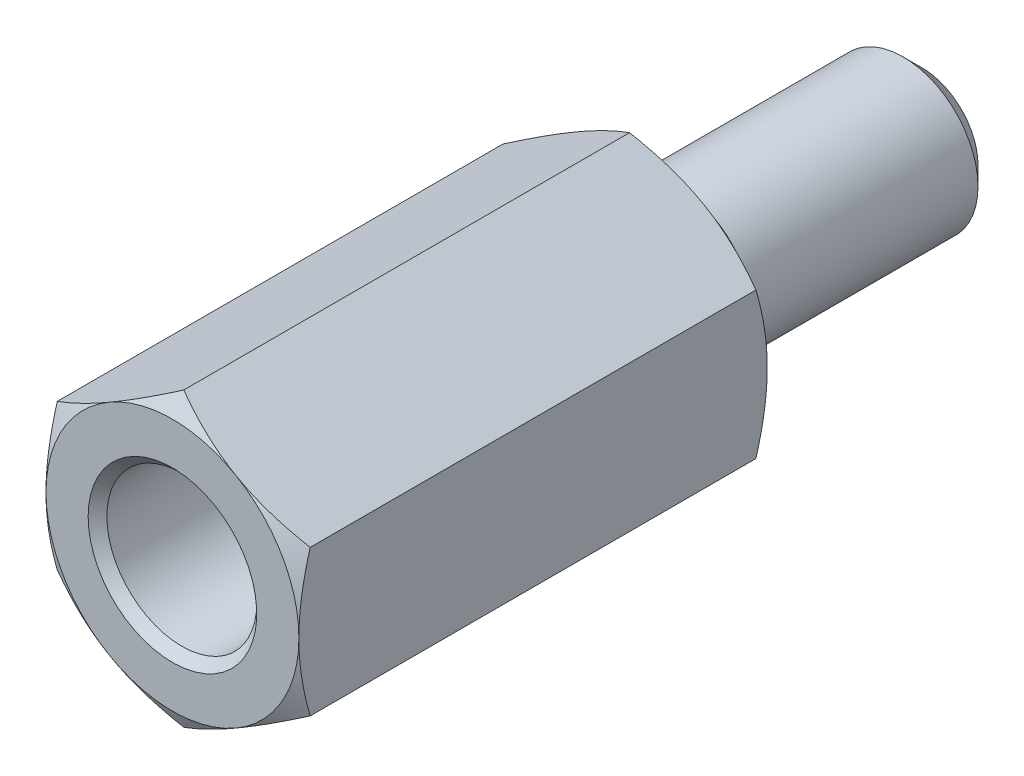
ISO-10303-21;
HEADER;
FILE_DESCRIPTION(('STEP AP214'),'2;1');
FILE_NAME('part.step','',(''),(''),'','','');
FILE_SCHEMA(('AUTOMOTIVE_DESIGN { 1 0 10303 214 1 1 1 1 }'));
ENDSEC;
DATA;
#1=APPLICATION_CONTEXT('core data for automotive mechanical design processes');
#2=APPLICATION_PROTOCOL_DEFINITION('international standard','automotive_design',2000,#1);
#3=PRODUCT_CONTEXT('',#1,'mechanical');
#4=PRODUCT('Part','Part','',(#3));
#5=PRODUCT_RELATED_PRODUCT_CATEGORY('part','',(#4));
#6=PRODUCT_DEFINITION_FORMATION('','',#4);
#7=PRODUCT_DEFINITION_CONTEXT('part definition',#1,'design');
#8=PRODUCT_DEFINITION('design','',#6,#7);
#9=PRODUCT_DEFINITION_SHAPE('','',#8);
#10=(LENGTH_UNIT() NAMED_UNIT(*) SI_UNIT(.MILLI.,.METRE.));
#11=(NAMED_UNIT(*) PLANE_ANGLE_UNIT() SI_UNIT($,.RADIAN.));
#12=(NAMED_UNIT(*) SI_UNIT($,.STERADIAN.) SOLID_ANGLE_UNIT());
#13=UNCERTAINTY_MEASURE_WITH_UNIT(LENGTH_MEASURE(1.E-05),#10,'distance_accuracy_value','');
#14=(GEOMETRIC_REPRESENTATION_CONTEXT(3) GLOBAL_UNCERTAINTY_ASSIGNED_CONTEXT((#13)) GLOBAL_UNIT_ASSIGNED_CONTEXT((#10,
#11,#12)) REPRESENTATION_CONTEXT('',''));
#15=CARTESIAN_POINT('',(0.,0.,0.));
#16=DIRECTION('',(0.,0.,1.));
#17=DIRECTION('',(1.,0.,0.));
#18=AXIS2_PLACEMENT_3D('',#15,#16,#17);
#19=CARTESIAN_POINT('',(16.,0.,0.));
#20=DIRECTION('',(0.,0.,-1.));
#21=DIRECTION('',(-1.,0.,0.));
#22=AXIS2_PLACEMENT_3D('',#19,#20,#21);
#23=PLANE('',#22);
#24=CARTESIAN_POINT('',(0.,0.,0.));
#25=DIRECTION('',(0.,0.,-1.));
#26=DIRECTION('',(-1.,0.,0.));
#27=AXIS2_PLACEMENT_3D('',#24,#25,#26);
#28=CIRCLE('',#27,13.5);
#29=CARTESIAN_POINT('',(-6.75,-11.6913429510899,0.));
#30=VERTEX_POINT('',#29);
#31=CARTESIAN_POINT('',(-13.5,0.,0.));
#32=VERTEX_POINT('',#31);
#33=EDGE_CURVE('E136',#30,#32,#28,.T.);
#34=ORIENTED_EDGE('',*,*,#33,.T.);
#35=CARTESIAN_POINT('',(-6.75,11.6913429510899,0.));
#36=VERTEX_POINT('',#35);
#37=EDGE_CURVE('E134',#32,#36,#28,.T.);
#38=ORIENTED_EDGE('',*,*,#37,.T.);
#39=CARTESIAN_POINT('',(6.75,11.6913429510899,0.));
#40=VERTEX_POINT('',#39);
#41=EDGE_CURVE('E113',#36,#40,#28,.T.);
#42=ORIENTED_EDGE('',*,*,#41,.T.);
#43=CARTESIAN_POINT('',(13.5,0.,0.));
#44=VERTEX_POINT('',#43);
#45=EDGE_CURVE('E103',#40,#44,#28,.T.);
#46=ORIENTED_EDGE('',*,*,#45,.T.);
#47=CARTESIAN_POINT('',(6.75,-11.6913429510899,0.));
#48=VERTEX_POINT('',#47);
#49=EDGE_CURVE('E29',#44,#48,#28,.T.);
#50=ORIENTED_EDGE('',*,*,#49,.T.);
#51=EDGE_CURVE('E37',#48,#30,#28,.T.);
#52=ORIENTED_EDGE('',*,*,#51,.T.);
#53=EDGE_LOOP('',(#34,#38,#42,#46,#50,#52));
#54=FACE_BOUND('',#53,.T.);
#55=CARTESIAN_POINT('',(0.,0.,0.));
#56=DIRECTION('',(0.,0.,1.));
#57=DIRECTION('',(1.,0.,0.));
#58=AXIS2_PLACEMENT_3D('',#55,#56,#57);
#59=CIRCLE('',#58,6.5);
#60=CARTESIAN_POINT('',(6.5,0.,0.));
#61=VERTEX_POINT('',#60);
#62=EDGE_CURVE('E252',#61,#61,#59,.T.);
#63=ORIENTED_EDGE('',*,*,#62,.T.);
#64=EDGE_LOOP('',(#63));
#65=FACE_BOUND('',#64,.T.);
#66=ADVANCED_FACE('F14',(#54,#65),#23,.T.);
#67=CARTESIAN_POINT('',(0.,0.,80.));
#68=DIRECTION('',(0.,0.,1.));
#69=DIRECTION('',(1.,0.,0.));
#70=AXIS2_PLACEMENT_3D('',#67,#68,#69);
#71=CYLINDRICAL_SURFACE('',#70,6.5);
#72=CARTESIAN_POINT('',(0.,0.,-4.));
#73=DIRECTION('',(0.,0.,1.));
#74=DIRECTION('',(1.,0.,0.));
#75=AXIS2_PLACEMENT_3D('',#72,#73,#74);
#76=CIRCLE('',#75,6.5);
#77=CARTESIAN_POINT('',(6.5,0.,-4.));
#78=VERTEX_POINT('',#77);
#79=EDGE_CURVE('E249',#78,#78,#76,.T.);
#80=ORIENTED_EDGE('',*,*,#79,.T.);
#81=EDGE_LOOP('',(#80));
#82=FACE_BOUND('',#81,.T.);
#83=ORIENTED_EDGE('',*,*,#62,.F.);
#84=EDGE_LOOP('',(#83));
#85=FACE_BOUND('',#84,.T.);
#86=ADVANCED_FACE('F331',(#82,#85),#71,.T.);
#87=CARTESIAN_POINT('',(6.5,0.,-4.));
#88=DIRECTION('',(0.,0.,1.));
#89=DIRECTION('',(1.,0.,0.));
#90=AXIS2_PLACEMENT_3D('',#87,#88,#89);
#91=PLANE('',#90);
#92=CARTESIAN_POINT('',(0.,0.,-4.));
#93=DIRECTION('',(0.,0.,1.));
#94=DIRECTION('',(1.,0.,0.));
#95=AXIS2_PLACEMENT_3D('',#92,#93,#94);
#96=CIRCLE('',#95,8.);
#97=CARTESIAN_POINT('',(8.,0.,-4.));
#98=VERTEX_POINT('',#97);
#99=EDGE_CURVE('E246',#98,#98,#96,.T.);
#100=ORIENTED_EDGE('',*,*,#99,.T.);
#101=EDGE_LOOP('',(#100));
#102=FACE_BOUND('',#101,.T.);
#103=ORIENTED_EDGE('',*,*,#79,.F.);
#104=EDGE_LOOP('',(#103));
#105=FACE_BOUND('',#104,.T.);
#106=ADVANCED_FACE('F336',(#102,#105),#91,.T.);
#107=CARTESIAN_POINT('',(0.,0.,80.));
#108=DIRECTION('',(0.,0.,1.));
#109=DIRECTION('',(1.,0.,0.));
#110=AXIS2_PLACEMENT_3D('',#107,#108,#109);
#111=CYLINDRICAL_SURFACE('',#110,8.);
#112=CARTESIAN_POINT('',(0.,0.,-28.));
#113=DIRECTION('',(0.,0.,1.));
#114=DIRECTION('',(1.,0.,0.));
#115=AXIS2_PLACEMENT_3D('',#112,#113,#114);
#116=CIRCLE('',#115,8.);
#117=CARTESIAN_POINT('',(8.,0.,-28.));
#118=VERTEX_POINT('',#117);
#119=EDGE_CURVE('E355',#118,#118,#116,.T.);
#120=ORIENTED_EDGE('',*,*,#119,.T.);
#121=EDGE_LOOP('',(#120));
#122=FACE_BOUND('',#121,.T.);
#123=ORIENTED_EDGE('',*,*,#99,.F.);
#124=EDGE_LOOP('',(#123));
#125=FACE_BOUND('',#124,.T.);
#126=ADVANCED_FACE('F415',(#122,#125),#111,.T.);
#127=CARTESIAN_POINT('',(0.,0.,-30.));
#128=DIRECTION('',(0.,0.,1.));
#129=DIRECTION('',(1.,0.,0.));
#130=AXIS2_PLACEMENT_3D('',#127,#128,#129);
#131=PLANE('',#130);
#132=CARTESIAN_POINT('',(0.,0.,-30.));
#133=DIRECTION('',(0.,0.,1.));
#134=DIRECTION('',(1.,0.,0.));
#135=AXIS2_PLACEMENT_3D('',#132,#133,#134);
#136=CIRCLE('',#135,6.);
#137=CARTESIAN_POINT('',(6.,0.,-30.));
#138=VERTEX_POINT('',#137);
#139=EDGE_CURVE('E352',#138,#138,#136,.F.);
#140=ORIENTED_EDGE('',*,*,#139,.T.);
#141=EDGE_LOOP('',(#140));
#142=FACE_BOUND('',#141,.T.);
#143=ADVANCED_FACE('F411',(#142),#131,.F.);
#144=CARTESIAN_POINT('',(0.,0.,3.92386010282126));
#145=DIRECTION('',(0.,0.,1.));
#146=DIRECTION('',(1.,0.,0.));
#147=AXIS2_PLACEMENT_3D('',#144,#145,#146);
#148=CONICAL_SURFACE('',#147,20.2963250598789,1.0471975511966);
#149=ORIENTED_EDGE('',*,*,#41,.F.);
#150=CARTESIAN_POINT('',(-13.5002,7.79411316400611,1.20583803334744));
#151=CARTESIAN_POINT('',(-13.2034751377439,7.9654273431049,1.10693600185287));
#152=CARTESIAN_POINT('',(-12.9055928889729,8.13740973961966,1.01252193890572));
#153=CARTESIAN_POINT('',(-12.3074397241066,8.48275363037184,0.833917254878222));
#154=CARTESIAN_POINT('',(-12.0071680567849,8.65611555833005,0.74972999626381));
#155=CARTESIAN_POINT('',(-11.403655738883,9.00455355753,0.59271056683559));
#156=CARTESIAN_POINT('',(-11.1004098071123,9.17963267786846,0.519905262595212));
#157=CARTESIAN_POINT('',(-10.4918107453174,9.53100751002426,0.387213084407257));
#158=CARTESIAN_POINT('',(-10.1864577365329,9.70730315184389,0.327325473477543));
#159=CARTESIAN_POINT('',(-9.58146884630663,10.0565936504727,0.223015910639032));
#160=CARTESIAN_POINT('',(-9.28187788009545,10.2295625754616,0.178248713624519));
#161=CARTESIAN_POINT('',(-8.68132315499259,10.5762930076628,0.103183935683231));
#162=CARTESIAN_POINT('',(-8.38035936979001,10.7500545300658,0.0728866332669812));
#163=CARTESIAN_POINT('',(-7.77792621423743,11.0978694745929,0.0275266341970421));
#164=CARTESIAN_POINT('',(-7.47645787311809,11.2719223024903,0.0124458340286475));
#165=CARTESIAN_POINT('',(-6.87324289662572,11.6201886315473,-0.00215683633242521));
#166=CARTESIAN_POINT('',(-6.57149627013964,11.7944021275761,-0.00167918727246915));
#167=CARTESIAN_POINT('',(-6.00738189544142,12.1200937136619,0.013748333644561));
#168=CARTESIAN_POINT('',(-5.74497394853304,12.2715950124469,0.0268164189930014));
#169=CARTESIAN_POINT('',(-5.2207616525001,12.5742491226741,0.0644725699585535));
#170=CARTESIAN_POINT('',(-4.9589573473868,12.7254019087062,0.0890614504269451));
#171=CARTESIAN_POINT('',(-4.43609453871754,13.0272768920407,0.149330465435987));
#172=CARTESIAN_POINT('',(-4.17503683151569,13.1779986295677,0.1850197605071));
#173=CARTESIAN_POINT('',(-3.65414530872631,13.4787354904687,0.266863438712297));
#174=CARTESIAN_POINT('',(-3.39431157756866,13.6287505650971,0.313018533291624));
#175=CARTESIAN_POINT('',(-2.60557180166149,14.0841296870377,0.468349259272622));
#176=CARTESIAN_POINT('',(-2.07894982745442,14.3881750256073,0.593013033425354));
#177=CARTESIAN_POINT('',(-1.03355849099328,14.9917319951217,0.875948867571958));
#178=CARTESIAN_POINT('',(-0.514775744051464,15.2912513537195,1.03415447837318));
#179=CARTESIAN_POINT('',(0.000200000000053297,15.5885727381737,1.20583803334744));
#180=B_SPLINE_CURVE_WITH_KNOTS('',3,(#150,#151,#152,#153,#154,#155,#156,#157,#158,#159,#160,
#161,#162,#163,#164,#165,#166,#167,#168,#169,#170,#171,#172,#173,#174,#175,#176,#177,#178,#179),
.UNSPECIFIED.,.F.,.F.,(4,2,2,2,2,2,2,2,2,2,2,2,2,2,4),(0.,1.06987949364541,2.14010980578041,
3.21282939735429,4.28548777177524,5.33167033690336,6.37787303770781,7.42282956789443,
8.46775380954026,9.377387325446,10.2870851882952,11.1975357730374,12.1080482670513,
13.9691139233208,15.8265265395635),.UNSPECIFIED.);
#181=CARTESIAN_POINT('',(0.,15.5884572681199,1.20577136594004));
#182=VERTEX_POINT('',#181);
#183=EDGE_CURVE('E121',#36,#182,#180,.T.);
#184=ORIENTED_EDGE('',*,*,#183,.T.);
#185=CARTESIAN_POINT('',(13.5002,7.79411316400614,1.20583803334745));
#186=CARTESIAN_POINT('',(13.2034751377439,7.96542734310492,1.10693600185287));
#187=CARTESIAN_POINT('',(12.9055928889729,8.13740973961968,1.01252193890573));
#188=CARTESIAN_POINT('',(12.3074397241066,8.48275363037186,0.833917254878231));
#189=CARTESIAN_POINT('',(12.0071680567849,8.65611555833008,0.749729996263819));
#190=CARTESIAN_POINT('',(11.403655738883,9.00455355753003,0.592710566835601));
#191=CARTESIAN_POINT('',(11.1004098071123,9.17963267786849,0.519905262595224));
#192=CARTESIAN_POINT('',(10.4918107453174,9.53100751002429,0.387213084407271));
#193=CARTESIAN_POINT('',(10.1864577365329,9.70730315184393,0.327325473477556));
#194=CARTESIAN_POINT('',(9.58146884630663,10.0565936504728,0.223015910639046));
#195=CARTESIAN_POINT('',(9.28187788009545,10.2295625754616,0.178248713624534));
#196=CARTESIAN_POINT('',(8.68132315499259,10.5762930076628,0.103183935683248));
#197=CARTESIAN_POINT('',(8.38035936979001,10.7500545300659,0.0728866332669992));
#198=CARTESIAN_POINT('',(7.77792621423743,11.0978694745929,0.0275266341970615));
#199=CARTESIAN_POINT('',(7.47645787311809,11.2719223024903,0.0124458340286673));
#200=CARTESIAN_POINT('',(6.87324289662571,11.6201886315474,-0.00215683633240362));
#201=CARTESIAN_POINT('',(6.57149627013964,11.7944021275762,-0.00167918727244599));
#202=CARTESIAN_POINT('',(6.00738189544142,12.1200937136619,0.0137483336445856));
#203=CARTESIAN_POINT('',(5.74497394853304,12.271595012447,0.0268164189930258));
#204=CARTESIAN_POINT('',(5.22076165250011,12.5742491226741,0.0644725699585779));
#205=CARTESIAN_POINT('',(4.95895734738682,12.7254019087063,0.0890614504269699));
#206=CARTESIAN_POINT('',(4.43609453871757,13.0272768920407,0.149330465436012));
#207=CARTESIAN_POINT('',(4.17503683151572,13.1779986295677,0.185019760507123));
#208=CARTESIAN_POINT('',(3.65414530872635,13.4787354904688,0.266863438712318));
#209=CARTESIAN_POINT('',(3.39431157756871,13.6287505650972,0.313018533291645));
#210=CARTESIAN_POINT('',(2.60557180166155,14.0841296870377,0.468349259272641));
#211=CARTESIAN_POINT('',(2.07894982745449,14.3881750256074,0.593013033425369));
#212=CARTESIAN_POINT('',(1.03355849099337,14.9917319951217,0.875948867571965));
#213=CARTESIAN_POINT('',(0.514775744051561,15.2912513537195,1.03415447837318));
#214=CARTESIAN_POINT('',(-0.000199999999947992,15.5885727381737,1.20583803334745));
#215=B_SPLINE_CURVE_WITH_KNOTS('',3,(#185,#186,#187,#188,#189,#190,#191,#192,#193,#194,#195,
#196,#197,#198,#199,#200,#201,#202,#203,#204,#205,#206,#207,#208,#209,#210,#211,#212,#213,#214),
.UNSPECIFIED.,.F.,.F.,(4,2,2,2,2,2,2,2,2,2,2,2,2,2,4),(0.,1.06987949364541,2.14010980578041,
3.21282939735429,4.28548777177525,5.33167033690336,6.37787303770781,7.42282956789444,
8.46775380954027,9.37738732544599,10.2870851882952,11.1975357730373,12.1080482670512,
13.9691139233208,15.8265265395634),.UNSPECIFIED.);
#216=EDGE_CURVE('E118',#40,#182,#215,.T.);
#217=ORIENTED_EDGE('',*,*,#216,.F.);
#218=EDGE_LOOP('',(#149,#184,#217));
#219=FACE_BOUND('',#218,.T.);
#220=ADVANCED_FACE('F119',(#219),#148,.T.);
#221=CARTESIAN_POINT('',(-13.5,-21.0508333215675,6.64400283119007));
#222=CARTESIAN_POINT('',(-13.5,-20.7555486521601,6.50049803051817));
#223=CARTESIAN_POINT('',(-13.5,-20.4599205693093,6.35770019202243));
#224=CARTESIAN_POINT('',(-13.5,-19.8679059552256,6.07367832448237));
#225=CARTESIAN_POINT('',(-13.5,-19.5715194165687,5.93245431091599));
#226=CARTESIAN_POINT('',(-13.5,-18.681037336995,5.51134635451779));
#227=CARTESIAN_POINT('',(-13.5,-18.0857049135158,5.23406820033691));
#228=CARTESIAN_POINT('',(-13.5,-16.8879089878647,4.68664716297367));
#229=CARTESIAN_POINT('',(-13.5,-16.2854243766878,4.41655035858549));
#230=CARTESIAN_POINT('',(-13.5,-15.0757039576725,3.88725311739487));
#231=CARTESIAN_POINT('',(-13.5,-14.4684683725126,3.62805217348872));
#232=CARTESIAN_POINT('',(-13.5,-13.2282132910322,3.11512708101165));
#233=CARTESIAN_POINT('',(-13.5,-12.5950024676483,2.86186318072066));
#234=CARTESIAN_POINT('',(-13.5,-11.321210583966,2.3742263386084));
#235=CARTESIAN_POINT('',(-13.5,-10.6806287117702,2.13985550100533));
#236=CARTESIAN_POINT('',(-13.5,-9.39225875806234,1.69607748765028));
#237=CARTESIAN_POINT('',(-13.5,-8.74448788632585,1.48662074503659));
#238=CARTESIAN_POINT('',(-13.5,-7.43959342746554,1.09930402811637));
#239=CARTESIAN_POINT('',(-13.5,-6.78247281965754,0.921434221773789));
#240=CARTESIAN_POINT('',(-13.5,-5.79148687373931,0.685189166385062));
#241=CARTESIAN_POINT('',(-13.5,-5.46120417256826,0.611697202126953));
#242=CARTESIAN_POINT('',(-13.5,-4.79836087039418,0.47576304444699));
#243=CARTESIAN_POINT('',(-13.5,-4.46580031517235,0.413320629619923));
#244=CARTESIAN_POINT('',(-13.5,-3.79862219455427,0.300580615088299));
#245=CARTESIAN_POINT('',(-13.5,-3.46400466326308,0.25028281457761));
#246=CARTESIAN_POINT('',(-13.5,-2.79305778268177,0.16283099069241));
#247=CARTESIAN_POINT('',(-13.5,-2.45672850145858,0.125676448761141));
#248=CARTESIAN_POINT('',(-13.5,-1.78726902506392,0.0657215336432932));
#249=CARTESIAN_POINT('',(-13.5,-1.45415535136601,0.0427378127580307));
#250=CARTESIAN_POINT('',(-13.5,-0.787254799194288,0.0108840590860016));
#251=CARTESIAN_POINT('',(-13.5,-0.453467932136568,0.00201378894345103));
#252=CARTESIAN_POINT('',(-13.5,0.214182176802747,-0.00140162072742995));
#253=CARTESIAN_POINT('',(-13.5,0.548045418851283,0.00405327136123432));
#254=CARTESIAN_POINT('',(-13.5,1.2152418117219,0.0291537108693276));
#255=CARTESIAN_POINT('',(-13.5,1.54857493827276,0.048799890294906));
#256=CARTESIAN_POINT('',(-13.5,2.34623754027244,0.112373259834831));
#257=CARTESIAN_POINT('',(-13.5,2.81005503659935,0.162842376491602));
#258=CARTESIAN_POINT('',(-13.5,3.73432558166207,0.288535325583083));
#259=CARTESIAN_POINT('',(-13.5,4.19477817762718,0.363762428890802));
#260=CARTESIAN_POINT('',(-13.5,5.11185364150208,0.536295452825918));
#261=CARTESIAN_POINT('',(-13.5,5.56847330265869,0.633618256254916));
#262=CARTESIAN_POINT('',(-13.5,6.47717042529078,0.84736630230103));
#263=CARTESIAN_POINT('',(-13.5,6.92924794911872,0.963791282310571));
#264=CARTESIAN_POINT('',(-13.5,7.83886410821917,1.21567249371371));
#265=CARTESIAN_POINT('',(-13.5,8.29630084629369,1.35149415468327));
#266=CARTESIAN_POINT('',(-13.5,9.2066697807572,1.63740020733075));
#267=CARTESIAN_POINT('',(-13.5,9.65960194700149,1.78748469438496));
#268=CARTESIAN_POINT('',(-13.5,10.5611814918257,2.09951338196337));
#269=CARTESIAN_POINT('',(-13.5,11.009830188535,2.2614537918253));
#270=CARTESIAN_POINT('',(-13.5,11.9033948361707,2.59526670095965));
#271=CARTESIAN_POINT('',(-13.5,12.348310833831,2.76713907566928));
#272=CARTESIAN_POINT('',(-13.5,13.409568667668,3.18856060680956));
#273=CARTESIAN_POINT('',(-13.5,14.0243541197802,3.4420235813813));
#274=CARTESIAN_POINT('',(-13.5,15.2485807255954,3.9615809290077));
#275=CARTESIAN_POINT('',(-13.5,15.858021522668,4.2276761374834));
#276=CARTESIAN_POINT('',(-13.5,17.0725710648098,4.76993262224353));
#277=CARTESIAN_POINT('',(-13.5,17.6776787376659,5.04609629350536));
#278=CARTESIAN_POINT('',(-13.5,18.8841500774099,5.60642791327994));
#279=CARTESIAN_POINT('',(-13.5,19.4855138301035,5.89059567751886));
#280=CARTESIAN_POINT('',(-13.5,20.6858175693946,6.46574899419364));
#281=CARTESIAN_POINT('',(-13.5,21.2847539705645,6.75674201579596));
#282=CARTESIAN_POINT('',(-13.5,22.4800111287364,7.34405053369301));
#283=CARTESIAN_POINT('',(-13.5,23.0763318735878,7.6403660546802));
#284=CARTESIAN_POINT('',(-13.5,24.26668277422,8.23735447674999));
#285=CARTESIAN_POINT('',(-13.5,24.8607132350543,8.53802677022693));
#286=CARTESIAN_POINT('',(-13.5,26.0469003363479,9.14304716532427));
#287=CARTESIAN_POINT('',(-13.5,26.6390569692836,9.44739528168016));
#288=CARTESIAN_POINT('',(-13.5,28.311642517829,10.312562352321));
#289=CARTESIAN_POINT('',(-13.5,29.3902043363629,10.8769907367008));
#290=CARTESIAN_POINT('',(-13.5,31.5433176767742,12.0135250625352));
#291=CARTESIAN_POINT('',(-13.5,32.6178690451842,12.5856312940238));
#292=CARTESIAN_POINT('',(-13.5,34.7610360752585,13.7342115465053));
#293=CARTESIAN_POINT('',(-13.5,35.8296599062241,14.3106703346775));
#294=CARTESIAN_POINT('',(-13.5,37.4307096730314,15.1787597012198));
#295=CARTESIAN_POINT('',(-13.5,37.964063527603,15.4686814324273));
#296=CARTESIAN_POINT('',(-13.5,39.0302146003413,16.0495447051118));
#297=CARTESIAN_POINT('',(-13.5,39.5630118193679,16.3404862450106));
#298=CARTESIAN_POINT('',(-13.5,40.095562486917,16.6318785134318));
#299=B_SPLINE_CURVE_WITH_KNOTS('',3,(#221,#222,#223,#224,#225,#226,#227,#228,#229,#230,#231,
#232,#233,#234,#235,#236,#237,#238,#239,#240,#241,#242,#243,#244,#245,#246,#247,#248,#249,#250,
#251,#252,#253,#254,#255,#256,#257,#258,#259,#260,#261,#262,#263,#264,#265,#266,#267,#268,#269,
#270,#271,#272,#273,#274,#275,#276,#277,#278,#279,#280,#281,#282,#283,#284,#285,#286,#287,#288,
#289,#290,#291,#292,#293,#294,#295,#296,#297,#298),.UNSPECIFIED.,.F.,.F.,(4,2,2,2,2,2,2,2,2,2,2,
2,2,2,2,2,2,2,2,2,2,2,2,2,2,2,2,2,2,2,2,2,2,2,2,2,2,2,4),(0.,0.984924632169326,1.96985894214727,
3.94001315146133,5.92070158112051,7.90129772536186,9.94701152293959,11.9929528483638,
14.0347531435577,16.0759167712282,17.0908429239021,18.1057487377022,19.1206377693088,
20.135486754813,21.1369134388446,22.1383232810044,23.1397353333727,24.1411919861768,
25.5400862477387,26.9391653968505,28.3393171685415,29.7394496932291,31.1706969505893,
32.6019537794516,34.0327549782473,35.4635382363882,37.4582990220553,39.4531919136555,
41.4485624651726,43.4438871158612,45.4415078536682,47.4391378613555,49.4364919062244,
51.433853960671,55.0857756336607,58.7378356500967,62.3803957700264,64.2015727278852,
66.0227468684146),.UNSPECIFIED.);
#300=CARTESIAN_POINT('',(-13.5,7.79422863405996,1.20577136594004));
#301=VERTEX_POINT('',#300);
#302=EDGE_CURVE('E135',#32,#301,#299,.T.);
#303=ORIENTED_EDGE('',*,*,#302,.T.);
#304=EDGE_CURVE('E262',#301,#36,#180,.T.);
#305=ORIENTED_EDGE('',*,*,#304,.T.);
#306=ORIENTED_EDGE('',*,*,#37,.F.);
#307=EDGE_LOOP('',(#303,#305,#306));
#308=FACE_BOUND('',#307,.T.);
#309=ADVANCED_FACE('F154',(#308),#148,.T.);
#310=CARTESIAN_POINT('',(-13.5,-7.79422863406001,1.20577136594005));
#311=VERTEX_POINT('',#310);
#312=EDGE_CURVE('E145',#311,#32,#299,.T.);
#313=ORIENTED_EDGE('',*,*,#312,.T.);
#314=ORIENTED_EDGE('',*,*,#33,.F.);
#315=CARTESIAN_POINT('',(-13.5002,-7.79411316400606,1.20583803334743));
#316=CARTESIAN_POINT('',(-13.2034751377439,-7.96542734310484,1.10693600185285));
#317=CARTESIAN_POINT('',(-12.9055928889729,-8.1374097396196,1.01252193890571));
#318=CARTESIAN_POINT('',(-12.3074397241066,-8.48275363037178,0.833917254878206));
#319=CARTESIAN_POINT('',(-12.0071680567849,-8.65611555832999,0.749729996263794));
#320=CARTESIAN_POINT('',(-11.403655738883,-9.00455355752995,0.592710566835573));
#321=CARTESIAN_POINT('',(-11.1004098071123,-9.1796326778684,0.519905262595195));
#322=CARTESIAN_POINT('',(-10.4918107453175,-9.5310075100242,0.387213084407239));
#323=CARTESIAN_POINT('',(-10.1864577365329,-9.70730315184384,0.327325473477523));
#324=CARTESIAN_POINT('',(-9.58146884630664,-10.0565936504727,0.223015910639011));
#325=CARTESIAN_POINT('',(-9.28187788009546,-10.2295625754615,0.178248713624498));
#326=CARTESIAN_POINT('',(-8.68132315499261,-10.5762930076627,0.103183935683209));
#327=CARTESIAN_POINT('',(-8.38035936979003,-10.7500545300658,0.0728866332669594));
#328=CARTESIAN_POINT('',(-7.77792621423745,-11.0978694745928,0.027526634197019));
#329=CARTESIAN_POINT('',(-7.47645787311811,-11.2719223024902,0.0124458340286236));
#330=CARTESIAN_POINT('',(-6.87324289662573,-11.6201886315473,-0.00215683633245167));
#331=CARTESIAN_POINT('',(-6.57149627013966,-11.7944021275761,-0.00167918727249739));
#332=CARTESIAN_POINT('',(-6.00738189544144,-12.1200937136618,0.0137483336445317));
#333=CARTESIAN_POINT('',(-5.74497394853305,-12.2715950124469,0.0268164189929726));
#334=CARTESIAN_POINT('',(-5.22076165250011,-12.574249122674,0.0644725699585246));
#335=CARTESIAN_POINT('',(-4.95895734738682,-12.7254019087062,0.0890614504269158));
#336=CARTESIAN_POINT('',(-4.43609453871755,-13.0272768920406,0.149330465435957));
#337=CARTESIAN_POINT('',(-4.1750368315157,-13.1779986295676,0.185019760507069));
#338=CARTESIAN_POINT('',(-3.65414530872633,-13.4787354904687,0.266863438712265));
#339=CARTESIAN_POINT('',(-3.39431157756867,-13.6287505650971,0.313018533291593));
#340=CARTESIAN_POINT('',(-2.60557180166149,-14.0841296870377,0.468349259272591));
#341=CARTESIAN_POINT('',(-2.07894982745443,-14.3881750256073,0.593013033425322));
#342=CARTESIAN_POINT('',(-1.03355849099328,-14.9917319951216,0.875948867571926));
#343=CARTESIAN_POINT('',(-0.514775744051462,-15.2912513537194,1.03415447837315));
#344=CARTESIAN_POINT('',(0.000200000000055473,-15.5885727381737,1.20583803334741));
#345=B_SPLINE_CURVE_WITH_KNOTS('',3,(#315,#316,#317,#318,#319,#320,#321,#322,#323,#324,#325,
#326,#327,#328,#329,#330,#331,#332,#333,#334,#335,#336,#337,#338,#339,#340,#341,#342,#343,#344),
.UNSPECIFIED.,.F.,.F.,(4,2,2,2,2,2,2,2,2,2,2,2,2,2,4),(0.,1.0698794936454,2.14010980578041,
3.21282939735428,4.28548777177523,5.33167033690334,6.37787303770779,7.42282956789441,
8.46775380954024,9.37738732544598,10.2870851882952,11.1975357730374,12.1080482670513,
13.9691139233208,15.8265265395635),.UNSPECIFIED.);
#346=EDGE_CURVE('E124',#311,#30,#345,.T.);
#347=ORIENTED_EDGE('',*,*,#346,.F.);
#348=EDGE_LOOP('',(#313,#314,#347));
#349=FACE_BOUND('',#348,.T.);
#350=ADVANCED_FACE('F158',(#349),#148,.T.);
#351=CARTESIAN_POINT('',(13.5002,-7.79411316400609,1.20583803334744));
#352=CARTESIAN_POINT('',(13.2034751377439,-7.96542734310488,1.10693600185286));
#353=CARTESIAN_POINT('',(12.9055928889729,-8.13740973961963,1.01252193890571));
#354=CARTESIAN_POINT('',(12.3074397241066,-8.48275363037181,0.833917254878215));
#355=CARTESIAN_POINT('',(12.0071680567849,-8.65611555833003,0.749729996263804));
#356=CARTESIAN_POINT('',(11.403655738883,-9.00455355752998,0.592710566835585));
#357=CARTESIAN_POINT('',(11.1004098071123,-9.17963267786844,0.519905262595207));
#358=CARTESIAN_POINT('',(10.4918107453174,-9.53100751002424,0.387213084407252));
#359=CARTESIAN_POINT('',(10.1864577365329,-9.70730315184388,0.327325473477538));
#360=CARTESIAN_POINT('',(9.58146884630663,-10.0565936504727,0.223015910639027));
#361=CARTESIAN_POINT('',(9.28187788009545,-10.2295625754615,0.178248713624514));
#362=CARTESIAN_POINT('',(8.68132315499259,-10.5762930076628,0.103183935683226));
#363=CARTESIAN_POINT('',(8.38035936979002,-10.7500545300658,0.072886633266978));
#364=CARTESIAN_POINT('',(7.77792621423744,-11.0978694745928,0.02752663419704));
#365=CARTESIAN_POINT('',(7.4764578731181,-11.2719223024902,0.0124458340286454));
#366=CARTESIAN_POINT('',(6.87324289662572,-11.6201886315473,-0.00215683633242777));
#367=CARTESIAN_POINT('',(6.57149627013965,-11.7944021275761,-0.00167918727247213));
#368=CARTESIAN_POINT('',(6.00738189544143,-12.1200937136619,0.0137483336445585));
#369=CARTESIAN_POINT('',(5.74497394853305,-12.2715950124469,0.0268164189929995));
#370=CARTESIAN_POINT('',(5.22076165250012,-12.5742491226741,0.0644725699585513));
#371=CARTESIAN_POINT('',(4.95895734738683,-12.7254019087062,0.0890614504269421));
#372=CARTESIAN_POINT('',(4.43609453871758,-13.0272768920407,0.149330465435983));
#373=CARTESIAN_POINT('',(4.17503683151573,-13.1779986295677,0.185019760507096));
#374=CARTESIAN_POINT('',(3.65414530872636,-13.4787354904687,0.266863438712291));
#375=CARTESIAN_POINT('',(3.39431157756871,-13.6287505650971,0.313018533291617));
#376=CARTESIAN_POINT('',(2.60557180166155,-14.0841296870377,0.468349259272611));
#377=CARTESIAN_POINT('',(2.0789498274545,-14.3881750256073,0.593013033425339));
#378=CARTESIAN_POINT('',(1.03355849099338,-14.9917319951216,0.875948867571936));
#379=CARTESIAN_POINT('',(0.514775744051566,-15.2912513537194,1.03415447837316));
#380=CARTESIAN_POINT('',(-0.000199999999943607,-15.5885727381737,1.20583803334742));
#381=B_SPLINE_CURVE_WITH_KNOTS('',3,(#351,#352,#353,#354,#355,#356,#357,#358,#359,#360,#361,
#362,#363,#364,#365,#366,#367,#368,#369,#370,#371,#372,#373,#374,#375,#376,#377,#378,#379,#380),
.UNSPECIFIED.,.F.,.F.,(4,2,2,2,2,2,2,2,2,2,2,2,2,2,4),(0.,1.06987949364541,2.14010980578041,
3.21282939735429,4.28548777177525,5.33167033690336,6.37787303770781,7.42282956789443,
8.46775380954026,9.37738732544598,10.2870851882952,11.1975357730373,12.1080482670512,
13.9691139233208,15.8265265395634),.UNSPECIFIED.);
#382=CARTESIAN_POINT('',(0.,-15.5884572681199,1.20577136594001));
#383=VERTEX_POINT('',#382);
#384=EDGE_CURVE('E184',#48,#383,#381,.T.);
#385=ORIENTED_EDGE('',*,*,#384,.T.);
#386=EDGE_CURVE('E130',#30,#383,#345,.T.);
#387=ORIENTED_EDGE('',*,*,#386,.F.);
#388=ORIENTED_EDGE('',*,*,#51,.F.);
#389=EDGE_LOOP('',(#385,#387,#388));
#390=FACE_BOUND('',#389,.T.);
#391=ADVANCED_FACE('F161',(#390),#148,.T.);
#392=CARTESIAN_POINT('',(13.5,-7.79422863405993,1.20577136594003));
#393=VERTEX_POINT('',#392);
#394=EDGE_CURVE('E190',#393,#48,#381,.T.);
#395=ORIENTED_EDGE('',*,*,#394,.T.);
#396=ORIENTED_EDGE('',*,*,#49,.F.);
#397=CARTESIAN_POINT('',(13.5,-21.0508333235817,6.64400283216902));
#398=CARTESIAN_POINT('',(13.5,-20.7555486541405,6.50049803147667));
#399=CARTESIAN_POINT('',(13.5,-20.4599205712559,6.35770019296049));
#400=CARTESIAN_POINT('',(13.5,-19.8679059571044,6.07367832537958));
#401=CARTESIAN_POINT('',(13.5,-19.5715194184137,5.93245431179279));
#402=CARTESIAN_POINT('',(13.5,-18.6810373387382,5.51134635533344));
#403=CARTESIAN_POINT('',(13.5,-18.085704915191,5.23406820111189));
#404=CARTESIAN_POINT('',(13.5,-16.8879089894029,4.68664716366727));
#405=CARTESIAN_POINT('',(13.5,-16.285424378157,4.41655035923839));
#406=CARTESIAN_POINT('',(13.5,-15.0757039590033,3.88725311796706));
#407=CARTESIAN_POINT('',(13.5,-14.4684683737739,3.62805217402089));
#408=CARTESIAN_POINT('',(13.5,-13.2282132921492,3.11512708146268));
#409=CARTESIAN_POINT('',(13.5,-12.5950024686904,2.86186318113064));
#410=CARTESIAN_POINT('',(13.5,-11.3212105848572,2.37422633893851));
#411=CARTESIAN_POINT('',(13.5,-10.6806287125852,2.13985550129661));
#412=CARTESIAN_POINT('',(13.5,-9.39225875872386,1.69607748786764));
#413=CARTESIAN_POINT('',(13.5,-8.74448788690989,1.48662074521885));
#414=CARTESIAN_POINT('',(13.5,-7.43959342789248,1.09930402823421));
#415=CARTESIAN_POINT('',(13.5,-6.78247282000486,0.921434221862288));
#416=CARTESIAN_POINT('',(13.5,-5.79148687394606,0.685189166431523));
#417=CARTESIAN_POINT('',(13.5,-5.46120417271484,0.611697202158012));
#418=CARTESIAN_POINT('',(13.5,-4.79836087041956,0.475763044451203));
#419=CARTESIAN_POINT('',(13.5,-4.4658003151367,0.413320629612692));
#420=CARTESIAN_POINT('',(13.5,-3.7986221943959,0.300580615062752));
#421=CARTESIAN_POINT('',(13.5,-3.46400466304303,0.250282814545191));
#422=CARTESIAN_POINT('',(13.5,-2.79305778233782,0.162830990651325));
#423=CARTESIAN_POINT('',(13.5,-2.45672850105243,0.125676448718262));
#424=CARTESIAN_POINT('',(13.5,-1.78726902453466,0.06572153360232));
#425=CARTESIAN_POINT('',(13.5,-1.45415535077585,0.042737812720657));
#426=CARTESIAN_POINT('',(13.5,-0.787254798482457,0.0108840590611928));
#427=CARTESIAN_POINT('',(13.5,-0.453467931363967,0.00201378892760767));
#428=CARTESIAN_POINT('',(13.5,0.214182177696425,-0.00140162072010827));
#429=CARTESIAN_POINT('',(13.5,0.548045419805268,0.00405327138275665));
#430=CARTESIAN_POINT('',(13.5,1.2152418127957,0.029153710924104));
#431=CARTESIAN_POINT('',(13.5,1.54857493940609,0.0487998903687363));
#432=CARTESIAN_POINT('',(13.5,2.34623754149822,0.112373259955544));
#433=CARTESIAN_POINT('',(13.5,2.81005503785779,0.162842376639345));
#434=CARTESIAN_POINT('',(13.5,3.73432558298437,0.288535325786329));
#435=CARTESIAN_POINT('',(13.5,4.19477817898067,0.363762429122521));
#436=CARTESIAN_POINT('',(13.5,5.11185364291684,0.536295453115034));
#437=CARTESIAN_POINT('',(13.5,5.56847330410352,0.633618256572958));
#438=CARTESIAN_POINT('',(13.5,6.47717042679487,0.847366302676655));
#439=CARTESIAN_POINT('',(13.5,6.92924795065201,0.963791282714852));
#440=CARTESIAN_POINT('',(13.5,7.83886410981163,1.21567249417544));
#441=CARTESIAN_POINT('',(13.5,8.29630084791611,1.3514941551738));
#442=CARTESIAN_POINT('',(13.5,9.20666978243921,1.63740020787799));
#443=CARTESIAN_POINT('',(13.5,9.65960194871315,1.78748469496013));
#444=CARTESIAN_POINT('',(13.5,10.5611814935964,2.09951338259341));
#445=CARTESIAN_POINT('',(13.5,11.0098301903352,2.26145379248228));
#446=CARTESIAN_POINT('',(13.5,11.9033948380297,2.59526670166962));
#447=CARTESIAN_POINT('',(13.5,12.3483108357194,2.76713907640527));
#448=CARTESIAN_POINT('',(13.5,13.4095686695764,3.18856060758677));
#449=CARTESIAN_POINT('',(13.5,14.0243541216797,3.44202358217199));
#450=CARTESIAN_POINT('',(13.5,15.248580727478,3.9615809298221));
#451=CARTESIAN_POINT('',(13.5,15.8580215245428,4.22767613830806));
#452=CARTESIAN_POINT('',(13.5,17.0725710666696,4.76993262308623));
#453=CARTESIAN_POINT('',(13.5,17.6776787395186,5.04609629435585));
#454=CARTESIAN_POINT('',(13.5,18.8841500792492,5.60642791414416));
#455=CARTESIAN_POINT('',(13.5,19.4855138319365,5.89059567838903));
#456=CARTESIAN_POINT('',(13.5,20.6858175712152,6.46574899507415));
#457=CARTESIAN_POINT('',(13.5,21.284753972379,6.75674201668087));
#458=CARTESIAN_POINT('',(13.5,22.4800111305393,7.34405053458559));
#459=CARTESIAN_POINT('',(13.5,23.0763318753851,7.64036605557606));
#460=CARTESIAN_POINT('',(13.5,24.2666827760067,8.23735447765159));
#461=CARTESIAN_POINT('',(13.5,24.8607132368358,8.53802677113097));
#462=CARTESIAN_POINT('',(13.5,26.0469003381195,9.14304716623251));
#463=CARTESIAN_POINT('',(13.5,26.6390569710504,9.44739528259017));
#464=CARTESIAN_POINT('',(13.5,28.3116425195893,10.3125623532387));
#465=CARTESIAN_POINT('',(13.5,29.3902043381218,10.8769907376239));
#466=CARTESIAN_POINT('',(13.5,31.5433176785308,12.0135250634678));
#467=CARTESIAN_POINT('',(13.5,32.6178690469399,12.5856312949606));
#468=CARTESIAN_POINT('',(13.5,34.7610360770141,13.7342115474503));
#469=CARTESIAN_POINT('',(13.5,35.8296599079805,14.3106703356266));
#470=CARTESIAN_POINT('',(13.5,37.4307096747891,15.1787597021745));
#471=CARTESIAN_POINT('',(13.5,37.9640635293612,15.4686814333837));
#472=CARTESIAN_POINT('',(13.5,39.0302146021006,16.0495447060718));
#473=CARTESIAN_POINT('',(13.5,39.5630118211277,16.3404862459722));
#474=CARTESIAN_POINT('',(13.5,40.0955624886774,16.631878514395));
#475=B_SPLINE_CURVE_WITH_KNOTS('',3,(#397,#398,#399,#400,#401,#402,#403,#404,#405,#406,#407,
#408,#409,#410,#411,#412,#413,#414,#415,#416,#417,#418,#419,#420,#421,#422,#423,#424,#425,#426,
#427,#428,#429,#430,#431,#432,#433,#434,#435,#436,#437,#438,#439,#440,#441,#442,#443,#444,#445,
#446,#447,#448,#449,#450,#451,#452,#453,#454,#455,#456,#457,#458,#459,#460,#461,#462,#463,#464,
#465,#466,#467,#468,#469,#470,#471,#472,#473,#474),.UNSPECIFIED.,.F.,.F.,(4,2,2,2,2,2,2,2,2,2,2,
2,2,2,2,2,2,2,2,2,2,2,2,2,2,2,2,2,2,2,2,2,2,2,2,2,2,2,4),(0.,0.984924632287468,1.96985894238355,
3.94001315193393,5.92070158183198,7.90129772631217,9.94701152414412,11.9929528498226,
14.03475314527,16.0759167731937,17.0908429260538,18.10574874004,19.1206377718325,
20.1354867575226,21.1369134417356,22.1383232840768,23.1397353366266,24.1411919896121,
25.5400862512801,26.9391654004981,28.3393171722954,29.7394496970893,31.1706969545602,
32.6019537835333,34.0327549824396,35.463538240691,37.4582990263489,39.4531919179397,
41.4485624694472,43.4438871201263,45.4415078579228,47.4391378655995,49.436491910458,
51.4338539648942,55.0857756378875,58.7378356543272,62.3803957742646,64.2015727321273,
66.0227468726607),.UNSPECIFIED.);
#476=EDGE_CURVE('E401',#393,#44,#475,.T.);
#477=ORIENTED_EDGE('',*,*,#476,.F.);
#478=EDGE_LOOP('',(#395,#396,#477));
#479=FACE_BOUND('',#478,.T.);
#480=ADVANCED_FACE('F160',(#479),#148,.T.);
#481=ORIENTED_EDGE('',*,*,#45,.F.);
#482=CARTESIAN_POINT('',(13.5,7.79422863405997,1.20577136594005));
#483=VERTEX_POINT('',#482);
#484=EDGE_CURVE('E107',#483,#40,#215,.T.);
#485=ORIENTED_EDGE('',*,*,#484,.F.);
#486=EDGE_CURVE('E109',#44,#483,#475,.T.);
#487=ORIENTED_EDGE('',*,*,#486,.F.);
#488=EDGE_LOOP('',(#481,#485,#487));
#489=FACE_BOUND('',#488,.T.);
#490=ADVANCED_FACE('F105',(#489),#148,.T.);
#491=CARTESIAN_POINT('',(0.,0.,20.));
#492=DIRECTION('',(0.,0.,1.));
#493=DIRECTION('',(1.,0.,0.));
#494=AXIS2_PLACEMENT_3D('',#491,#492,#493);
#495=PLANE('',#494);
#496=CARTESIAN_POINT('',(0.,0.,20.));
#497=DIRECTION('',(0.,0.,1.));
#498=DIRECTION('',(1.,0.,0.));
#499=AXIS2_PLACEMENT_3D('',#496,#497,#498);
#500=CIRCLE('',#499,8.);
#501=CARTESIAN_POINT('',(8.,0.,20.));
#502=VERTEX_POINT('',#501);
#503=EDGE_CURVE('E232',#502,#502,#500,.T.);
#504=ORIENTED_EDGE('',*,*,#503,.T.);
#505=EDGE_LOOP('',(#504));
#506=FACE_BOUND('',#505,.T.);
#507=ADVANCED_FACE('F318',(#506),#495,.T.);
#508=CARTESIAN_POINT('',(0.,0.,80.));
#509=DIRECTION('',(0.,0.,1.));
#510=DIRECTION('',(1.,0.,0.));
#511=AXIS2_PLACEMENT_3D('',#508,#509,#510);
#512=CYLINDRICAL_SURFACE('',#511,8.);
#513=CARTESIAN_POINT('',(0.,0.,49.));
#514=DIRECTION('',(0.,0.,-1.));
#515=DIRECTION('',(-1.,0.,0.));
#516=AXIS2_PLACEMENT_3D('',#513,#514,#515);
#517=CIRCLE('',#516,8.);
#518=CARTESIAN_POINT('',(-8.,0.,49.));
#519=VERTEX_POINT('',#518);
#520=EDGE_CURVE('E22',#519,#519,#517,.F.);
#521=ORIENTED_EDGE('',*,*,#520,.T.);
#522=EDGE_LOOP('',(#521));
#523=FACE_BOUND('',#522,.T.);
#524=ORIENTED_EDGE('',*,*,#503,.F.);
#525=EDGE_LOOP('',(#524));
#526=FACE_BOUND('',#525,.T.);
#527=ADVANCED_FACE('F321',(#523,#526),#512,.F.);
#528=CARTESIAN_POINT('',(16.,0.,50.));
#529=DIRECTION('',(0.,0.,-1.));
#530=DIRECTION('',(-1.,0.,0.));
#531=AXIS2_PLACEMENT_3D('',#528,#529,#530);
#532=PLANE('',#531);
#533=CARTESIAN_POINT('',(0.,0.,50.));
#534=DIRECTION('',(0.,0.,-1.));
#535=DIRECTION('',(-1.,0.,0.));
#536=AXIS2_PLACEMENT_3D('',#533,#534,#535);
#537=CIRCLE('',#536,9.);
#538=CARTESIAN_POINT('',(-9.,0.,50.));
#539=VERTEX_POINT('',#538);
#540=EDGE_CURVE('E9',#539,#539,#537,.T.);
#541=ORIENTED_EDGE('',*,*,#540,.T.);
#542=EDGE_LOOP('',(#541));
#543=FACE_BOUND('',#542,.T.);
#544=CARTESIAN_POINT('',(0.,0.,50.));
#545=DIRECTION('',(0.,0.,-1.));
#546=DIRECTION('',(-1.,0.,0.));
#547=AXIS2_PLACEMENT_3D('',#544,#545,#546);
#548=CIRCLE('',#547,13.5);
#549=CARTESIAN_POINT('',(-13.5,0.,50.));
#550=VERTEX_POINT('',#549);
#551=CARTESIAN_POINT('',(-6.75,11.69134295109,50.));
#552=VERTEX_POINT('',#551);
#553=EDGE_CURVE('E309',#550,#552,#548,.T.);
#554=ORIENTED_EDGE('',*,*,#553,.F.);
#555=CARTESIAN_POINT('',(0.,0.,50.));
#556=DIRECTION('',(0.,0.,-1.));
#557=DIRECTION('',(-1.,0.,0.));
#558=AXIS2_PLACEMENT_3D('',#555,#556,#557);
#559=CIRCLE('',#558,13.5);
#560=CARTESIAN_POINT('',(-6.75,-11.6913429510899,50.));
#561=VERTEX_POINT('',#560);
#562=EDGE_CURVE('E255',#550,#561,#559,.F.);
#563=ORIENTED_EDGE('',*,*,#562,.T.);
#564=CARTESIAN_POINT('',(6.75,-11.6913429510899,50.));
#565=VERTEX_POINT('',#564);
#566=EDGE_CURVE('E257',#561,#565,#559,.F.);
#567=ORIENTED_EDGE('',*,*,#566,.T.);
#568=CARTESIAN_POINT('',(13.5,0.,50.));
#569=VERTEX_POINT('',#568);
#570=EDGE_CURVE('E263',#565,#569,#559,.F.);
#571=ORIENTED_EDGE('',*,*,#570,.T.);
#572=CARTESIAN_POINT('',(6.75,11.6913429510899,50.));
#573=VERTEX_POINT('',#572);
#574=EDGE_CURVE('E264',#569,#573,#559,.F.);
#575=ORIENTED_EDGE('',*,*,#574,.T.);
#576=EDGE_CURVE('E254',#573,#552,#559,.F.);
#577=ORIENTED_EDGE('',*,*,#576,.T.);
#578=EDGE_LOOP('',(#554,#563,#567,#571,#575,#577));
#579=FACE_BOUND('',#578,.T.);
#580=ADVANCED_FACE('F273',(#543,#579),#532,.F.);
#581=CARTESIAN_POINT('',(0.,0.,50.));
#582=DIRECTION('',(0.,0.,-1.));
#583=DIRECTION('',(-1.,0.,0.));
#584=AXIS2_PLACEMENT_3D('',#581,#582,#583);
#585=CONICAL_SURFACE('',#584,13.5,1.0471975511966);
#586=CARTESIAN_POINT('',(-0.000199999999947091,15.5885727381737,48.7941619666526));
#587=CARTESIAN_POINT('',(0.296524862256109,15.417258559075,48.8930639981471));
#588=CARTESIAN_POINT('',(0.594407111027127,15.2452761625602,48.9874780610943));
#589=CARTESIAN_POINT('',(1.19256027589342,14.899932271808,49.1660827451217));
#590=CARTESIAN_POINT('',(1.49283194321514,14.7265703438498,49.2502700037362));
#591=CARTESIAN_POINT('',(2.0963442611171,14.3781323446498,49.4072894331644));
#592=CARTESIAN_POINT('',(2.39959019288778,14.2030532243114,49.4800947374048));
#593=CARTESIAN_POINT('',(3.00818925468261,13.8516783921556,49.6127869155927));
#594=CARTESIAN_POINT('',(3.31354226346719,13.6753827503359,49.6726745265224));
#595=CARTESIAN_POINT('',(3.91853115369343,13.3260922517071,49.7769840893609));
#596=CARTESIAN_POINT('',(4.21812211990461,13.1531233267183,49.8217512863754));
#597=CARTESIAN_POINT('',(4.81867684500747,12.806392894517,49.8968160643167));
#598=CARTESIAN_POINT('',(5.11964063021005,12.632631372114,49.927113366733));
#599=CARTESIAN_POINT('',(5.72207378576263,12.284816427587,49.9724733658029));
#600=CARTESIAN_POINT('',(6.02354212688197,12.1107635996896,49.9875541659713));
#601=CARTESIAN_POINT('',(6.62675710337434,11.7624972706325,50.0021568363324));
#602=CARTESIAN_POINT('',(6.92850372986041,11.5882837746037,50.0016791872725));
#603=CARTESIAN_POINT('',(7.49261810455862,11.2625921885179,49.9862516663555));
#604=CARTESIAN_POINT('',(7.755026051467,11.1110908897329,49.973183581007));
#605=CARTESIAN_POINT('',(8.27923834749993,10.8084367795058,49.9355274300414));
#606=CARTESIAN_POINT('',(8.54104265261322,10.6572839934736,49.910938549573));
#607=CARTESIAN_POINT('',(9.06390546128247,10.3554090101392,49.850669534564));
#608=CARTESIAN_POINT('',(9.32496316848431,10.2046872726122,49.8149802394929));
#609=CARTESIAN_POINT('',(9.84585469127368,9.90395041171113,49.7331365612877));
#610=CARTESIAN_POINT('',(10.1056884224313,9.75393533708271,49.6869814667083));
#611=CARTESIAN_POINT('',(10.8944281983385,9.29855621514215,49.5316507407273));
#612=CARTESIAN_POINT('',(11.4210501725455,8.99451087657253,49.4069869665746));
#613=CARTESIAN_POINT('',(12.4664415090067,8.3909539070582,49.124051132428));
#614=CARTESIAN_POINT('',(12.9852242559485,8.09143454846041,48.9658455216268));
#615=CARTESIAN_POINT('',(13.5002,7.79411316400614,48.7941619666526));
#616=B_SPLINE_CURVE_WITH_KNOTS('',3,(#586,#587,#588,#589,#590,#591,#592,#593,#594,#595,#596,
#597,#598,#599,#600,#601,#602,#603,#604,#605,#606,#607,#608,#609,#610,#611,#612,#613,#614,#615),
.UNSPECIFIED.,.F.,.F.,(4,2,2,2,2,2,2,2,2,2,2,2,2,2,4),(0.,1.0698794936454,2.1401098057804,
3.21282939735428,4.28548777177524,5.33167033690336,6.37787303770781,7.42282956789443,
8.46775380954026,9.37738732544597,10.2870851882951,11.1975357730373,12.1080482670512,
13.9691139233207,15.8265265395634),.UNSPECIFIED.);
#617=CARTESIAN_POINT('',(13.5,7.79422863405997,48.79422863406));
#618=VERTEX_POINT('',#617);
#619=EDGE_CURVE('E215',#573,#618,#616,.T.);
#620=ORIENTED_EDGE('',*,*,#619,.F.);
#621=ORIENTED_EDGE('',*,*,#574,.F.);
#622=CARTESIAN_POINT('',(13.5,-21.0508333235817,43.355997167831));
#623=CARTESIAN_POINT('',(13.5,-20.7555486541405,43.4995019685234));
#624=CARTESIAN_POINT('',(13.5,-20.4599205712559,43.6422998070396));
#625=CARTESIAN_POINT('',(13.5,-19.8679059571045,43.9263216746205));
#626=CARTESIAN_POINT('',(13.5,-19.5715194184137,44.0675456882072));
#627=CARTESIAN_POINT('',(13.5,-18.6810373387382,44.4886536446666));
#628=CARTESIAN_POINT('',(13.5,-18.085704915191,44.7659317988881));
#629=CARTESIAN_POINT('',(13.5,-16.8879089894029,45.3133528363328));
#630=CARTESIAN_POINT('',(13.5,-16.285424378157,45.5834496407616));
#631=CARTESIAN_POINT('',(13.5,-15.0757039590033,46.112746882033));
#632=CARTESIAN_POINT('',(13.5,-14.4684683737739,46.3719478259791));
#633=CARTESIAN_POINT('',(13.5,-13.2282132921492,46.8848729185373));
#634=CARTESIAN_POINT('',(13.5,-12.5950024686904,47.1381368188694));
#635=CARTESIAN_POINT('',(13.5,-11.3212105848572,47.6257736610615));
#636=CARTESIAN_POINT('',(13.5,-10.6806287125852,47.8601444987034));
#637=CARTESIAN_POINT('',(13.5,-9.39225875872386,48.3039225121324));
#638=CARTESIAN_POINT('',(13.5,-8.74448788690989,48.5133792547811));
#639=CARTESIAN_POINT('',(13.5,-7.43959342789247,48.9006959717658));
#640=CARTESIAN_POINT('',(13.5,-6.78247282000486,49.0785657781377));
#641=CARTESIAN_POINT('',(13.5,-5.79148687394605,49.3148108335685));
#642=CARTESIAN_POINT('',(13.5,-5.46120417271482,49.388302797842));
#643=CARTESIAN_POINT('',(13.5,-4.79836087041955,49.5242369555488));
#644=CARTESIAN_POINT('',(13.5,-4.46580031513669,49.5866793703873));
#645=CARTESIAN_POINT('',(13.5,-3.79862219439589,49.6994193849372));
#646=CARTESIAN_POINT('',(13.5,-3.46400466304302,49.7497171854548));
#647=CARTESIAN_POINT('',(13.5,-2.79305778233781,49.8371690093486));
#648=CARTESIAN_POINT('',(13.5,-2.45672850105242,49.8743235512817));
#649=CARTESIAN_POINT('',(13.5,-1.78726902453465,49.9342784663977));
#650=CARTESIAN_POINT('',(13.5,-1.45415535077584,49.9572621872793));
#651=CARTESIAN_POINT('',(13.5,-0.787254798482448,49.9891159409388));
#652=CARTESIAN_POINT('',(13.5,-0.453467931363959,49.9979862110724));
#653=CARTESIAN_POINT('',(13.5,0.214182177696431,50.0014016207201));
#654=CARTESIAN_POINT('',(13.5,0.548045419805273,49.9959467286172));
#655=CARTESIAN_POINT('',(13.5,1.21524181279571,49.9708462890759));
#656=CARTESIAN_POINT('',(13.5,1.54857493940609,49.9512001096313));
#657=CARTESIAN_POINT('',(13.5,2.34623754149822,49.8876267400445));
#658=CARTESIAN_POINT('',(13.5,2.81005503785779,49.8371576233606));
#659=CARTESIAN_POINT('',(13.5,3.73432558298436,49.7114646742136));
#660=CARTESIAN_POINT('',(13.5,4.19477817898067,49.6362375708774));
#661=CARTESIAN_POINT('',(13.5,5.11185364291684,49.4637045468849));
#662=CARTESIAN_POINT('',(13.5,5.56847330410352,49.366381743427));
#663=CARTESIAN_POINT('',(13.5,6.47717042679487,49.1526336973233));
#664=CARTESIAN_POINT('',(13.5,6.92924795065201,49.0362087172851));
#665=CARTESIAN_POINT('',(13.5,7.83886410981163,48.7843275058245));
#666=CARTESIAN_POINT('',(13.5,8.29630084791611,48.6485058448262));
#667=CARTESIAN_POINT('',(13.5,9.20666978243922,48.362599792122));
#668=CARTESIAN_POINT('',(13.5,9.65960194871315,48.2125153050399));
#669=CARTESIAN_POINT('',(13.5,10.5611814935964,47.9004866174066));
#670=CARTESIAN_POINT('',(13.5,11.0098301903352,47.7385462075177));
#671=CARTESIAN_POINT('',(13.5,11.9033948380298,47.4047332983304));
#672=CARTESIAN_POINT('',(13.5,12.3483108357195,47.2328609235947));
#673=CARTESIAN_POINT('',(13.5,13.4095686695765,46.8114393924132));
#674=CARTESIAN_POINT('',(13.5,14.0243541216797,46.557976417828));
#675=CARTESIAN_POINT('',(13.5,15.2485807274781,46.0384190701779));
#676=CARTESIAN_POINT('',(13.5,15.8580215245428,45.772323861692));
#677=CARTESIAN_POINT('',(13.5,17.0725710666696,45.2300673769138));
#678=CARTESIAN_POINT('',(13.5,17.6776787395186,44.9539037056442));
#679=CARTESIAN_POINT('',(13.5,18.8841500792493,44.3935720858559));
#680=CARTESIAN_POINT('',(13.5,19.4855138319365,44.109404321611));
#681=CARTESIAN_POINT('',(13.5,20.6858175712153,43.5342510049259));
#682=CARTESIAN_POINT('',(13.5,21.2847539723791,43.2432579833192));
#683=CARTESIAN_POINT('',(13.5,22.4800111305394,42.6559494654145));
#684=CARTESIAN_POINT('',(13.5,23.0763318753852,42.359633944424));
#685=CARTESIAN_POINT('',(13.5,24.2666827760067,41.7626455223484));
#686=CARTESIAN_POINT('',(13.5,24.8607132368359,41.4619732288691));
#687=CARTESIAN_POINT('',(13.5,26.0469003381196,40.8569528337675));
#688=CARTESIAN_POINT('',(13.5,26.6390569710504,40.5526047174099));
#689=CARTESIAN_POINT('',(13.5,28.3116425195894,39.6874376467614));
#690=CARTESIAN_POINT('',(13.5,29.3902043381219,39.1230092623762));
#691=CARTESIAN_POINT('',(13.5,31.5433176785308,37.9864749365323));
#692=CARTESIAN_POINT('',(13.5,32.61786904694,37.4143687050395));
#693=CARTESIAN_POINT('',(13.5,34.7610360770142,36.2657884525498));
#694=CARTESIAN_POINT('',(13.5,35.8296599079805,35.6893296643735));
#695=CARTESIAN_POINT('',(13.5,37.4307096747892,34.8212402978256));
#696=CARTESIAN_POINT('',(13.5,37.9640635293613,34.5313185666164));
#697=CARTESIAN_POINT('',(13.5,39.0302146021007,33.9504552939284));
#698=CARTESIAN_POINT('',(13.5,39.5630118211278,33.6595137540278));
#699=CARTESIAN_POINT('',(13.5,40.0955624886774,33.368121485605));
#700=B_SPLINE_CURVE_WITH_KNOTS('',3,(#622,#623,#624,#625,#626,#627,#628,#629,#630,#631,#632,
#633,#634,#635,#636,#637,#638,#639,#640,#641,#642,#643,#644,#645,#646,#647,#648,#649,#650,#651,
#652,#653,#654,#655,#656,#657,#658,#659,#660,#661,#662,#663,#664,#665,#666,#667,#668,#669,#670,
#671,#672,#673,#674,#675,#676,#677,#678,#679,#680,#681,#682,#683,#684,#685,#686,#687,#688,#689,
#690,#691,#692,#693,#694,#695,#696,#697,#698,#699),.UNSPECIFIED.,.F.,.F.,(4,2,2,2,2,2,2,2,2,2,2,
2,2,2,2,2,2,2,2,2,2,2,2,2,2,2,2,2,2,2,2,2,2,2,2,2,2,2,4),(0.,0.984924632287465,1.96985894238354,
3.94001315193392,5.92070158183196,7.90129772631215,9.9470115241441,11.9929528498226,
14.03475314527,16.0759167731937,17.0908429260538,18.10574874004,19.1206377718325,
20.1354867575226,21.1369134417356,22.1383232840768,23.1397353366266,24.1411919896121,
25.5400862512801,26.939165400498,28.3393171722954,29.7394496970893,31.1706969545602,
32.6019537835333,34.0327549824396,35.463538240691,37.4582990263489,39.4531919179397,
41.4485624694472,43.4438871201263,45.4415078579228,47.4391378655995,49.436491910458,
51.4338539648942,55.0857756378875,58.7378356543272,62.3803957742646,64.2015727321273,
66.0227468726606),.UNSPECIFIED.);
#701=EDGE_CURVE('E231',#618,#569,#700,.F.);
#702=ORIENTED_EDGE('',*,*,#701,.F.);
#703=EDGE_LOOP('',(#620,#621,#702));
#704=FACE_BOUND('',#703,.T.);
#705=ADVANCED_FACE('F282',(#704),#585,.T.);
#706=ORIENTED_EDGE('',*,*,#570,.F.);
#707=CARTESIAN_POINT('',(-0.000199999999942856,-15.5885727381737,48.7941619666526));
#708=CARTESIAN_POINT('',(0.296524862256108,-15.4172585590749,48.8930639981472));
#709=CARTESIAN_POINT('',(0.594407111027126,-15.2452761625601,48.9874780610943));
#710=CARTESIAN_POINT('',(1.19256027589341,-14.899932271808,49.1660827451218));
#711=CARTESIAN_POINT('',(1.49283194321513,-14.7265703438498,49.2502700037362));
#712=CARTESIAN_POINT('',(2.0963442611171,-14.3781323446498,49.4072894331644));
#713=CARTESIAN_POINT('',(2.39959019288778,-14.2030532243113,49.4800947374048));
#714=CARTESIAN_POINT('',(3.0081892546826,-13.8516783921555,49.6127869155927));
#715=CARTESIAN_POINT('',(3.31354226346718,-13.6753827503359,49.6726745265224));
#716=CARTESIAN_POINT('',(3.91853115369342,-13.3260922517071,49.776984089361));
#717=CARTESIAN_POINT('',(4.2181221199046,-13.1531233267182,49.8217512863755));
#718=CARTESIAN_POINT('',(4.81867684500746,-12.806392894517,49.8968160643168));
#719=CARTESIAN_POINT('',(5.11964063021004,-12.632631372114,49.927113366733));
#720=CARTESIAN_POINT('',(5.72207378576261,-12.2848164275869,49.9724733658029));
#721=CARTESIAN_POINT('',(6.02354212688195,-12.1107635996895,49.9875541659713));
#722=CARTESIAN_POINT('',(6.62675710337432,-11.7624972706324,50.0021568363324));
#723=CARTESIAN_POINT('',(6.92850372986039,-11.5882837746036,50.0016791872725));
#724=CARTESIAN_POINT('',(7.49261810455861,-11.2625921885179,49.9862516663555));
#725=CARTESIAN_POINT('',(7.75502605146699,-11.1110908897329,49.973183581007));
#726=CARTESIAN_POINT('',(8.27923834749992,-10.8084367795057,49.9355274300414));
#727=CARTESIAN_POINT('',(8.54104265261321,-10.6572839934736,49.910938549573));
#728=CARTESIAN_POINT('',(9.06390546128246,-10.3554090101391,49.850669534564));
#729=CARTESIAN_POINT('',(9.32496316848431,-10.2046872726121,49.8149802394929));
#730=CARTESIAN_POINT('',(9.84585469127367,-9.90395041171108,49.7331365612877));
#731=CARTESIAN_POINT('',(10.1056884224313,-9.75393533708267,49.6869814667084));
#732=CARTESIAN_POINT('',(10.8944281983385,-9.2985562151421,49.5316507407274));
#733=CARTESIAN_POINT('',(11.4210501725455,-8.99451087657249,49.4069869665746));
#734=CARTESIAN_POINT('',(12.4664415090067,-8.39095390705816,49.124051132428));
#735=CARTESIAN_POINT('',(12.9852242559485,-8.09143454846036,48.9658455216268));
#736=CARTESIAN_POINT('',(13.5002,-7.79411316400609,48.7941619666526));
#737=B_SPLINE_CURVE_WITH_KNOTS('',3,(#707,#708,#709,#710,#711,#712,#713,#714,#715,#716,#717,
#718,#719,#720,#721,#722,#723,#724,#725,#726,#727,#728,#729,#730,#731,#732,#733,#734,#735,#736),
.UNSPECIFIED.,.F.,.F.,(4,2,2,2,2,2,2,2,2,2,2,2,2,2,4),(0.,1.0698794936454,2.1401098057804,
3.21282939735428,4.28548777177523,5.33167033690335,6.37787303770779,7.42282956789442,
8.46775380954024,9.37738732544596,10.2870851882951,11.1975357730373,12.1080482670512,
13.9691139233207,15.8265265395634),.UNSPECIFIED.);
#738=CARTESIAN_POINT('',(13.5,-7.79422863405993,48.79422863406));
#739=VERTEX_POINT('',#738);
#740=EDGE_CURVE('E217',#565,#739,#737,.T.);
#741=ORIENTED_EDGE('',*,*,#740,.T.);
#742=EDGE_CURVE('E224',#569,#739,#700,.F.);
#743=ORIENTED_EDGE('',*,*,#742,.F.);
#744=EDGE_LOOP('',(#706,#741,#743));
#745=FACE_BOUND('',#744,.T.);
#746=ADVANCED_FACE('F385',(#745),#585,.T.);
#747=CARTESIAN_POINT('',(0.,-15.5884572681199,48.79422863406));
#748=VERTEX_POINT('',#747);
#749=EDGE_CURVE('E208',#748,#565,#737,.T.);
#750=ORIENTED_EDGE('',*,*,#749,.T.);
#751=ORIENTED_EDGE('',*,*,#566,.F.);
#752=CARTESIAN_POINT('',(0.000200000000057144,-15.5885727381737,48.7941619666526));
#753=CARTESIAN_POINT('',(-0.296524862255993,-15.4172585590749,48.8930639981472));
#754=CARTESIAN_POINT('',(-0.59440711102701,-15.2452761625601,48.9874780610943));
#755=CARTESIAN_POINT('',(-1.1925602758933,-14.899932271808,49.1660827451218));
#756=CARTESIAN_POINT('',(-1.49283194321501,-14.7265703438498,49.2502700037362));
#757=CARTESIAN_POINT('',(-2.09634426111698,-14.3781323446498,49.4072894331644));
#758=CARTESIAN_POINT('',(-2.39959019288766,-14.2030532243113,49.4800947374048));
#759=CARTESIAN_POINT('',(-3.00818925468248,-13.8516783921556,49.6127869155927));
#760=CARTESIAN_POINT('',(-3.31354226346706,-13.6753827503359,49.6726745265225));
#761=CARTESIAN_POINT('',(-3.9185311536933,-13.3260922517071,49.776984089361));
#762=CARTESIAN_POINT('',(-4.21812211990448,-13.1531233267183,49.8217512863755));
#763=CARTESIAN_POINT('',(-4.81867684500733,-12.806392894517,49.8968160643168));
#764=CARTESIAN_POINT('',(-5.11964063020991,-12.632631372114,49.927113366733));
#765=CARTESIAN_POINT('',(-5.72207378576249,-12.284816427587,49.972473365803));
#766=CARTESIAN_POINT('',(-6.02354212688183,-12.1107635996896,49.9875541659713));
#767=CARTESIAN_POINT('',(-6.6267571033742,-11.7624972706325,50.0021568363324));
#768=CARTESIAN_POINT('',(-6.92850372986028,-11.5882837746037,50.0016791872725));
#769=CARTESIAN_POINT('',(-7.4926181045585,-11.2625921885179,49.9862516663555));
#770=CARTESIAN_POINT('',(-7.75502605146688,-11.1110908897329,49.973183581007));
#771=CARTESIAN_POINT('',(-8.27923834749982,-10.8084367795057,49.9355274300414));
#772=CARTESIAN_POINT('',(-8.54104265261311,-10.6572839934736,49.9109385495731));
#773=CARTESIAN_POINT('',(-9.06390546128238,-10.3554090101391,49.850669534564));
#774=CARTESIAN_POINT('',(-9.32496316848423,-10.2046872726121,49.8149802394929));
#775=CARTESIAN_POINT('',(-9.8458546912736,-9.90395041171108,49.7331365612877));
#776=CARTESIAN_POINT('',(-10.1056884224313,-9.75393533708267,49.6869814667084));
#777=CARTESIAN_POINT('',(-10.8944281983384,-9.29855621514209,49.5316507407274));
#778=CARTESIAN_POINT('',(-11.4210501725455,-8.99451087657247,49.4069869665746));
#779=CARTESIAN_POINT('',(-12.4664415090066,-8.39095390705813,49.1240511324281));
#780=CARTESIAN_POINT('',(-12.9852242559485,-8.09143454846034,48.9658455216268));
#781=CARTESIAN_POINT('',(-13.5002,-7.79411316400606,48.7941619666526));
#782=B_SPLINE_CURVE_WITH_KNOTS('',3,(#752,#753,#754,#755,#756,#757,#758,#759,#760,#761,#762,
#763,#764,#765,#766,#767,#768,#769,#770,#771,#772,#773,#774,#775,#776,#777,#778,#779,#780,#781),
.UNSPECIFIED.,.F.,.F.,(4,2,2,2,2,2,2,2,2,2,2,2,2,2,4),(0.,1.0698794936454,2.1401098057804,
3.21282939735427,4.28548777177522,5.33167033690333,6.37787303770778,7.4228295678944,
8.46775380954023,9.37738732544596,10.2870851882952,11.1975357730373,12.1080482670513,
13.9691139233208,15.8265265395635),.UNSPECIFIED.);
#783=EDGE_CURVE('E216',#748,#561,#782,.T.);
#784=ORIENTED_EDGE('',*,*,#783,.F.);
#785=EDGE_LOOP('',(#750,#751,#784));
#786=FACE_BOUND('',#785,.T.);
#787=ADVANCED_FACE('F382',(#786),#585,.T.);
#788=ORIENTED_EDGE('',*,*,#562,.F.);
#789=CARTESIAN_POINT('',(-13.5,-21.0508333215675,43.3559971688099));
#790=CARTESIAN_POINT('',(-13.5,-20.7555486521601,43.4995019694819));
#791=CARTESIAN_POINT('',(-13.5,-20.4599205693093,43.6422998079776));
#792=CARTESIAN_POINT('',(-13.5,-19.8679059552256,43.9263216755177));
#793=CARTESIAN_POINT('',(-13.5,-19.5715194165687,44.0675456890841));
#794=CARTESIAN_POINT('',(-13.5,-18.681037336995,44.4886536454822));
#795=CARTESIAN_POINT('',(-13.5,-18.0857049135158,44.7659317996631));
#796=CARTESIAN_POINT('',(-13.5,-16.8879089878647,45.3133528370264));
#797=CARTESIAN_POINT('',(-13.5,-16.2854243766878,45.5834496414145));
#798=CARTESIAN_POINT('',(-13.5,-15.0757039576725,46.1127468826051));
#799=CARTESIAN_POINT('',(-13.5,-14.4684683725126,46.3719478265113));
#800=CARTESIAN_POINT('',(-13.5,-13.2282132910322,46.8848729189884));
#801=CARTESIAN_POINT('',(-13.5,-12.5950024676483,47.1381368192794));
#802=CARTESIAN_POINT('',(-13.5,-11.321210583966,47.6257736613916));
#803=CARTESIAN_POINT('',(-13.5,-10.6806287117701,47.8601444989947));
#804=CARTESIAN_POINT('',(-13.5,-9.39225875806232,48.3039225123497));
#805=CARTESIAN_POINT('',(-13.5,-8.74448788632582,48.5133792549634));
#806=CARTESIAN_POINT('',(-13.5,-7.43959342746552,48.9006959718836));
#807=CARTESIAN_POINT('',(-13.5,-6.78247281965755,49.0785657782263));
#808=CARTESIAN_POINT('',(-13.5,-5.7914868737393,49.314810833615));
#809=CARTESIAN_POINT('',(-13.5,-5.46120417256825,49.388302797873));
#810=CARTESIAN_POINT('',(-13.5,-4.79836087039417,49.524236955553));
#811=CARTESIAN_POINT('',(-13.5,-4.46580031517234,49.5866793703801));
#812=CARTESIAN_POINT('',(-13.5,-3.79862219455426,49.6994193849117));
#813=CARTESIAN_POINT('',(-13.5,-3.46400466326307,49.7497171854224));
#814=CARTESIAN_POINT('',(-13.5,-2.79305778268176,49.8371690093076));
#815=CARTESIAN_POINT('',(-13.5,-2.45672850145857,49.8743235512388));
#816=CARTESIAN_POINT('',(-13.5,-1.78726902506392,49.9342784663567));
#817=CARTESIAN_POINT('',(-13.5,-1.45415535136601,49.9572621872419));
#818=CARTESIAN_POINT('',(-13.5,-0.787254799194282,49.989115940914));
#819=CARTESIAN_POINT('',(-13.5,-0.453467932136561,49.9979862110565));
#820=CARTESIAN_POINT('',(-13.5,0.214182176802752,50.0014016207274));
#821=CARTESIAN_POINT('',(-13.5,0.548045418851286,49.9959467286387));
#822=CARTESIAN_POINT('',(-13.5,1.2152418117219,49.9708462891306));
#823=CARTESIAN_POINT('',(-13.5,1.54857493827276,49.9512001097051));
#824=CARTESIAN_POINT('',(-13.5,2.34623754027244,49.8876267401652));
#825=CARTESIAN_POINT('',(-13.5,2.81005503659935,49.8371576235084));
#826=CARTESIAN_POINT('',(-13.5,3.73432558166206,49.7114646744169));
#827=CARTESIAN_POINT('',(-13.5,4.19477817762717,49.6362375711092));
#828=CARTESIAN_POINT('',(-13.5,5.11185364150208,49.4637045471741));
#829=CARTESIAN_POINT('',(-13.5,5.56847330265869,49.3663817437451));
#830=CARTESIAN_POINT('',(-13.5,6.47717042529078,49.1526336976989));
#831=CARTESIAN_POINT('',(-13.5,6.92924794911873,49.0362087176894));
#832=CARTESIAN_POINT('',(-13.5,7.83886410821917,48.7843275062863));
#833=CARTESIAN_POINT('',(-13.5,8.2963008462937,48.6485058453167));
#834=CARTESIAN_POINT('',(-13.5,9.20666978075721,48.3625997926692));
#835=CARTESIAN_POINT('',(-13.5,9.65960194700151,48.212515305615));
#836=CARTESIAN_POINT('',(-13.5,10.5611814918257,47.9004866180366));
#837=CARTESIAN_POINT('',(-13.5,11.0098301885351,47.7385462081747));
#838=CARTESIAN_POINT('',(-13.5,11.9033948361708,47.4047332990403));
#839=CARTESIAN_POINT('',(-13.5,12.348310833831,47.2328609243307));
#840=CARTESIAN_POINT('',(-13.5,13.4095686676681,46.8114393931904));
#841=CARTESIAN_POINT('',(-13.5,14.0243541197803,46.5579764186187));
#842=CARTESIAN_POINT('',(-13.5,15.2485807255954,46.0384190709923));
#843=CARTESIAN_POINT('',(-13.5,15.858021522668,45.7723238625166));
#844=CARTESIAN_POINT('',(-13.5,17.0725710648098,45.2300673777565));
#845=CARTESIAN_POINT('',(-13.5,17.6776787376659,44.9539037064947));
#846=CARTESIAN_POINT('',(-13.5,18.8841500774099,44.3935720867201));
#847=CARTESIAN_POINT('',(-13.5,19.4855138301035,44.1094043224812));
#848=CARTESIAN_POINT('',(-13.5,20.6858175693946,43.5342510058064));
#849=CARTESIAN_POINT('',(-13.5,21.2847539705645,43.2432579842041));
#850=CARTESIAN_POINT('',(-13.5,22.4800111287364,42.655949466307));
#851=CARTESIAN_POINT('',(-13.5,23.0763318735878,42.3596339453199));
#852=CARTESIAN_POINT('',(-13.5,24.26668277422,41.7626455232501));
#853=CARTESIAN_POINT('',(-13.5,24.8607132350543,41.4619732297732));
#854=CARTESIAN_POINT('',(-13.5,26.0469003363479,40.8569528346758));
#855=CARTESIAN_POINT('',(-13.5,26.6390569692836,40.5526047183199));
#856=CARTESIAN_POINT('',(-13.5,28.311642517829,39.6874376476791));
#857=CARTESIAN_POINT('',(-13.5,29.3902043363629,39.1230092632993));
#858=CARTESIAN_POINT('',(-13.5,31.5433176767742,37.9864749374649));
#859=CARTESIAN_POINT('',(-13.5,32.6178690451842,37.4143687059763));
#860=CARTESIAN_POINT('',(-13.5,34.7610360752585,36.2657884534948));
#861=CARTESIAN_POINT('',(-13.5,35.8296599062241,35.6893296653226));
#862=CARTESIAN_POINT('',(-13.5,37.4307096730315,34.8212402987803));
#863=CARTESIAN_POINT('',(-13.5,37.964063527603,34.5313185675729));
#864=CARTESIAN_POINT('',(-13.5,39.0302146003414,33.9504552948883));
#865=CARTESIAN_POINT('',(-13.5,39.5630118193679,33.6595137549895));
#866=CARTESIAN_POINT('',(-13.5,40.095562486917,33.3681214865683));
#867=B_SPLINE_CURVE_WITH_KNOTS('',3,(#789,#790,#791,#792,#793,#794,#795,#796,#797,#798,#799,
#800,#801,#802,#803,#804,#805,#806,#807,#808,#809,#810,#811,#812,#813,#814,#815,#816,#817,#818,
#819,#820,#821,#822,#823,#824,#825,#826,#827,#828,#829,#830,#831,#832,#833,#834,#835,#836,#837,
#838,#839,#840,#841,#842,#843,#844,#845,#846,#847,#848,#849,#850,#851,#852,#853,#854,#855,#856,
#857,#858,#859,#860,#861,#862,#863,#864,#865,#866),.UNSPECIFIED.,.F.,.F.,(4,2,2,2,2,2,2,2,2,2,2,
2,2,2,2,2,2,2,2,2,2,2,2,2,2,2,2,2,2,2,2,2,2,2,2,2,2,2,4),(0.,0.984924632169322,1.96985894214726,
3.94001315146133,5.92070158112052,7.90129772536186,9.9470115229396,11.9929528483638,
14.0347531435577,16.0759167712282,17.0908429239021,18.1057487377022,19.1206377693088,
20.135486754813,21.1369134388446,22.1383232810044,23.1397353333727,24.1411919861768,
25.5400862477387,26.9391653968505,28.3393171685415,29.7394496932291,31.1706969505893,
32.6019537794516,34.0327549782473,35.4635382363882,37.4582990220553,39.4531919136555,
41.4485624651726,43.4438871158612,45.4415078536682,47.4391378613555,49.4364919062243,
51.4338539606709,55.0857756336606,58.7378356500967,62.3803957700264,64.2015727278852,
66.0227468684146),.UNSPECIFIED.);
#868=CARTESIAN_POINT('',(-13.5,-7.79422863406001,48.79422863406));
#869=VERTEX_POINT('',#868);
#870=EDGE_CURVE('E290',#550,#869,#867,.F.);
#871=ORIENTED_EDGE('',*,*,#870,.T.);
#872=EDGE_CURVE('E218',#561,#869,#782,.T.);
#873=ORIENTED_EDGE('',*,*,#872,.F.);
#874=EDGE_LOOP('',(#788,#871,#873));
#875=FACE_BOUND('',#874,.T.);
#876=ADVANCED_FACE('F374',(#875),#585,.T.);
#877=CARTESIAN_POINT('',(0.000200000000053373,15.5885727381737,48.7941619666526));
#878=CARTESIAN_POINT('',(-0.296524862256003,15.417258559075,48.8930639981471));
#879=CARTESIAN_POINT('',(-0.594407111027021,15.2452761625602,48.9874780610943));
#880=CARTESIAN_POINT('',(-1.19256027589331,14.899932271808,49.1660827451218));
#881=CARTESIAN_POINT('',(-1.49283194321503,14.7265703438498,49.2502700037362));
#882=CARTESIAN_POINT('',(-2.096344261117,14.3781323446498,49.4072894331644));
#883=CARTESIAN_POINT('',(-2.39959019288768,14.2030532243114,49.4800947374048));
#884=CARTESIAN_POINT('',(-3.00818925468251,13.8516783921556,49.6127869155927));
#885=CARTESIAN_POINT('',(-3.31354226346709,13.675382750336,49.6726745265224));
#886=CARTESIAN_POINT('',(-3.91853115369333,13.3260922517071,49.7769840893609));
#887=CARTESIAN_POINT('',(-4.21812211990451,13.1531233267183,49.8217512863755));
#888=CARTESIAN_POINT('',(-4.81867684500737,12.8063928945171,49.8968160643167));
#889=CARTESIAN_POINT('',(-5.11964063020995,12.632631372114,49.927113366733));
#890=CARTESIAN_POINT('',(-5.72207378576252,12.284816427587,49.9724733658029));
#891=CARTESIAN_POINT('',(-6.02354212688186,12.1107635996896,49.9875541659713));
#892=CARTESIAN_POINT('',(-6.62675710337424,11.7624972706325,50.0021568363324));
#893=CARTESIAN_POINT('',(-6.92850372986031,11.5882837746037,50.0016791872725));
#894=CARTESIAN_POINT('',(-7.49261810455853,11.262592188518,49.9862516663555));
#895=CARTESIAN_POINT('',(-7.75502605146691,11.1110908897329,49.973183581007));
#896=CARTESIAN_POINT('',(-8.27923834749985,10.8084367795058,49.9355274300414));
#897=CARTESIAN_POINT('',(-8.54104265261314,10.6572839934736,49.910938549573));
#898=CARTESIAN_POINT('',(-9.0639054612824,10.3554090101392,49.850669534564));
#899=CARTESIAN_POINT('',(-9.32496316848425,10.2046872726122,49.8149802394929));
#900=CARTESIAN_POINT('',(-9.84585469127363,9.90395041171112,49.7331365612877));
#901=CARTESIAN_POINT('',(-10.1056884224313,9.75393533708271,49.6869814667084));
#902=CARTESIAN_POINT('',(-10.8944281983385,9.29855621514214,49.5316507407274));
#903=CARTESIAN_POINT('',(-11.4210501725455,8.99451087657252,49.4069869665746));
#904=CARTESIAN_POINT('',(-12.4664415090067,8.39095390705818,49.124051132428));
#905=CARTESIAN_POINT('',(-12.9852242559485,8.09143454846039,48.9658455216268));
#906=CARTESIAN_POINT('',(-13.5002,7.79411316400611,48.7941619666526));
#907=B_SPLINE_CURVE_WITH_KNOTS('',3,(#877,#878,#879,#880,#881,#882,#883,#884,#885,#886,#887,
#888,#889,#890,#891,#892,#893,#894,#895,#896,#897,#898,#899,#900,#901,#902,#903,#904,#905,#906),
.UNSPECIFIED.,.F.,.F.,(4,2,2,2,2,2,2,2,2,2,2,2,2,2,4),(0.,1.0698794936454,2.1401098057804,
3.21282939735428,4.28548777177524,5.33167033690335,6.37787303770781,7.42282956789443,
8.46775380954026,9.37738732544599,10.2870851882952,11.1975357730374,12.1080482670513,
13.9691139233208,15.8265265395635),.UNSPECIFIED.);
#908=CARTESIAN_POINT('',(0.,15.5884572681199,48.79422863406));
#909=VERTEX_POINT('',#908);
#910=EDGE_CURVE('E294',#909,#552,#907,.T.);
#911=ORIENTED_EDGE('',*,*,#910,.T.);
#912=ORIENTED_EDGE('',*,*,#576,.F.);
#913=EDGE_CURVE('E284',#909,#573,#616,.T.);
#914=ORIENTED_EDGE('',*,*,#913,.F.);
#915=EDGE_LOOP('',(#911,#912,#914));
#916=FACE_BOUND('',#915,.T.);
#917=ADVANCED_FACE('F391',(#916),#585,.T.);
#918=CARTESIAN_POINT('',(-13.5,7.79422863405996,48.79422863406));
#919=VERTEX_POINT('',#918);
#920=EDGE_CURVE('E291',#919,#550,#867,.F.);
#921=ORIENTED_EDGE('',*,*,#920,.T.);
#922=ORIENTED_EDGE('',*,*,#553,.T.);
#923=EDGE_CURVE('E299',#552,#919,#907,.T.);
#924=ORIENTED_EDGE('',*,*,#923,.T.);
#925=EDGE_LOOP('',(#921,#922,#924));
#926=FACE_BOUND('',#925,.T.);
#927=ADVANCED_FACE('F162',(#926),#585,.T.);
#928=CARTESIAN_POINT('',(0.,15.5884572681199,0.));
#929=DIRECTION('',(-0.5,0.866025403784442,0.));
#930=DIRECTION('',(-0.866025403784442,-0.5,0.));
#931=AXIS2_PLACEMENT_3D('',#928,#929,#930);
#932=PLANE('',#931);
#933=ORIENTED_EDGE('',*,*,#304,.F.);
#934=DIRECTION('',(0.,0.,1.));
#935=VECTOR('',#934,1.);
#936=CARTESIAN_POINT('',(-13.5,7.79422863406,0.));
#937=LINE('',#936,#935);
#938=EDGE_CURVE('E237',#301,#919,#937,.T.);
#939=ORIENTED_EDGE('',*,*,#938,.T.);
#940=ORIENTED_EDGE('',*,*,#923,.F.);
#941=ORIENTED_EDGE('',*,*,#910,.F.);
#942=DIRECTION('',(0.,0.,1.));
#943=VECTOR('',#942,1.);
#944=CARTESIAN_POINT('',(0.,15.5884572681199,0.));
#945=LINE('',#944,#943);
#946=EDGE_CURVE('E235',#182,#909,#945,.T.);
#947=ORIENTED_EDGE('',*,*,#946,.F.);
#948=ORIENTED_EDGE('',*,*,#183,.F.);
#949=EDGE_LOOP('',(#933,#939,#940,#941,#947,#948));
#950=FACE_BOUND('',#949,.T.);
#951=ADVANCED_FACE('F310',(#950),#932,.T.);
#952=CARTESIAN_POINT('',(-13.5,7.79422863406,0.));
#953=DIRECTION('',(-1.,0.,0.));
#954=DIRECTION('',(0.,-1.,0.));
#955=AXIS2_PLACEMENT_3D('',#952,#953,#954);
#956=PLANE('',#955);
#957=ORIENTED_EDGE('',*,*,#312,.F.);
#958=DIRECTION('',(0.,0.,1.));
#959=VECTOR('',#958,1.);
#960=CARTESIAN_POINT('',(-13.5,-7.79422863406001,0.));
#961=LINE('',#960,#959);
#962=EDGE_CURVE('E239',#311,#869,#961,.T.);
#963=ORIENTED_EDGE('',*,*,#962,.T.);
#964=ORIENTED_EDGE('',*,*,#870,.F.);
#965=ORIENTED_EDGE('',*,*,#920,.F.);
#966=ORIENTED_EDGE('',*,*,#938,.F.);
#967=ORIENTED_EDGE('',*,*,#302,.F.);
#968=EDGE_LOOP('',(#957,#963,#964,#965,#966,#967));
#969=FACE_BOUND('',#968,.T.);
#970=ADVANCED_FACE('F151',(#969),#956,.T.);
#971=CARTESIAN_POINT('',(0.,-15.5884572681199,0.));
#972=DIRECTION('',(0.5,0.866025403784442,0.));
#973=DIRECTION('',(-0.866025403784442,0.5,0.));
#974=AXIS2_PLACEMENT_3D('',#971,#972,#973);
#975=PLANE('',#974);
#976=ORIENTED_EDGE('',*,*,#962,.F.);
#977=ORIENTED_EDGE('',*,*,#346,.T.);
#978=ORIENTED_EDGE('',*,*,#386,.T.);
#979=DIRECTION('',(0.,0.,1.));
#980=VECTOR('',#979,1.);
#981=CARTESIAN_POINT('',(0.,-15.5884572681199,0.));
#982=LINE('',#981,#980);
#983=EDGE_CURVE('E241',#383,#748,#982,.T.);
#984=ORIENTED_EDGE('',*,*,#983,.T.);
#985=ORIENTED_EDGE('',*,*,#783,.T.);
#986=ORIENTED_EDGE('',*,*,#872,.T.);
#987=EDGE_LOOP('',(#976,#977,#978,#984,#985,#986));
#988=FACE_BOUND('',#987,.T.);
#989=ADVANCED_FACE('F201',(#988),#975,.F.);
#990=CARTESIAN_POINT('',(0.,-15.5884572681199,0.));
#991=DIRECTION('',(0.5,-0.866025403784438,0.));
#992=DIRECTION('',(0.866025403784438,0.5,0.));
#993=AXIS2_PLACEMENT_3D('',#990,#991,#992);
#994=PLANE('',#993);
#995=ORIENTED_EDGE('',*,*,#394,.F.);
#996=DIRECTION('',(0.,0.,1.));
#997=VECTOR('',#996,1.);
#998=CARTESIAN_POINT('',(13.5,-7.79422863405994,0.));
#999=LINE('',#998,#997);
#1000=EDGE_CURVE('E243',#393,#739,#999,.T.);
#1001=ORIENTED_EDGE('',*,*,#1000,.T.);
#1002=ORIENTED_EDGE('',*,*,#740,.F.);
#1003=ORIENTED_EDGE('',*,*,#749,.F.);
#1004=ORIENTED_EDGE('',*,*,#983,.F.);
#1005=ORIENTED_EDGE('',*,*,#384,.F.);
#1006=EDGE_LOOP('',(#995,#1001,#1002,#1003,#1004,#1005));
#1007=FACE_BOUND('',#1006,.T.);
#1008=ADVANCED_FACE('F197',(#1007),#994,.T.);
#1009=CARTESIAN_POINT('',(13.5,7.79422863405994,0.));
#1010=DIRECTION('',(-1.,0.,0.));
#1011=DIRECTION('',(0.,-1.,0.));
#1012=AXIS2_PLACEMENT_3D('',#1009,#1010,#1011);
#1013=PLANE('',#1012);
#1014=ORIENTED_EDGE('',*,*,#1000,.F.);
#1015=ORIENTED_EDGE('',*,*,#476,.T.);
#1016=ORIENTED_EDGE('',*,*,#486,.T.);
#1017=DIRECTION('',(0.,0.,1.));
#1018=VECTOR('',#1017,1.);
#1019=CARTESIAN_POINT('',(13.5,7.79422863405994,0.));
#1020=LINE('',#1019,#1018);
#1021=EDGE_CURVE('E129',#483,#618,#1020,.T.);
#1022=ORIENTED_EDGE('',*,*,#1021,.T.);
#1023=ORIENTED_EDGE('',*,*,#701,.T.);
#1024=ORIENTED_EDGE('',*,*,#742,.T.);
#1025=EDGE_LOOP('',(#1014,#1015,#1016,#1022,#1023,#1024));
#1026=FACE_BOUND('',#1025,.T.);
#1027=ADVANCED_FACE('F200',(#1026),#1013,.F.);
#1028=CARTESIAN_POINT('',(0.,15.5884572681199,0.));
#1029=DIRECTION('',(-0.5,-0.866025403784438,0.));
#1030=DIRECTION('',(0.866025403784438,-0.5,0.));
#1031=AXIS2_PLACEMENT_3D('',#1028,#1029,#1030);
#1032=PLANE('',#1031);
#1033=ORIENTED_EDGE('',*,*,#1021,.F.);
#1034=ORIENTED_EDGE('',*,*,#484,.T.);
#1035=ORIENTED_EDGE('',*,*,#216,.T.);
#1036=ORIENTED_EDGE('',*,*,#946,.T.);
#1037=ORIENTED_EDGE('',*,*,#913,.T.);
#1038=ORIENTED_EDGE('',*,*,#619,.T.);
#1039=EDGE_LOOP('',(#1033,#1034,#1035,#1036,#1037,#1038));
#1040=FACE_BOUND('',#1039,.T.);
#1041=ADVANCED_FACE('F127',(#1040),#1032,.F.);
#1042=CARTESIAN_POINT('',(0.,0.,-28.));
#1043=DIRECTION('',(0.,0.,1.));
#1044=DIRECTION('',(1.,0.,0.));
#1045=AXIS2_PLACEMENT_3D('',#1042,#1043,#1044);
#1046=CONICAL_SURFACE('',#1045,8.,0.785398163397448);
#1047=ORIENTED_EDGE('',*,*,#139,.F.);
#1048=EDGE_LOOP('',(#1047));
#1049=FACE_BOUND('',#1048,.T.);
#1050=ORIENTED_EDGE('',*,*,#119,.F.);
#1051=EDGE_LOOP('',(#1050));
#1052=FACE_BOUND('',#1051,.T.);
#1053=ADVANCED_FACE('F317',(#1049,#1052),#1046,.T.);
#1054=CARTESIAN_POINT('',(0.,0.,49.));
#1055=DIRECTION('',(0.,0.,1.));
#1056=DIRECTION('',(1.,0.,0.));
#1057=AXIS2_PLACEMENT_3D('',#1054,#1055,#1056);
#1058=CONICAL_SURFACE('',#1057,8.,0.785398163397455);
#1059=ORIENTED_EDGE('',*,*,#540,.F.);
#1060=EDGE_LOOP('',(#1059));
#1061=FACE_BOUND('',#1060,.T.);
#1062=ORIENTED_EDGE('',*,*,#520,.F.);
#1063=EDGE_LOOP('',(#1062));
#1064=FACE_BOUND('',#1063,.T.);
#1065=ADVANCED_FACE('F16',(#1061,#1064),#1058,.F.);
#1066=CLOSED_SHELL('',(#66,#86,#106,#126,#143,#220,#309,#350,#391,#480,#490,#507,#527,#580,#705,
#746,#787,#876,#917,#927,#951,#970,#989,#1008,#1027,#1041,#1053,#1065));
#1067=MANIFOLD_SOLID_BREP('B1',#1066);
#1068=ADVANCED_BREP_SHAPE_REPRESENTATION('',(#18,#1067),#14);
#1069=SHAPE_DEFINITION_REPRESENTATION(#9,#1068);
ENDSEC;
END-ISO-10303-21;
